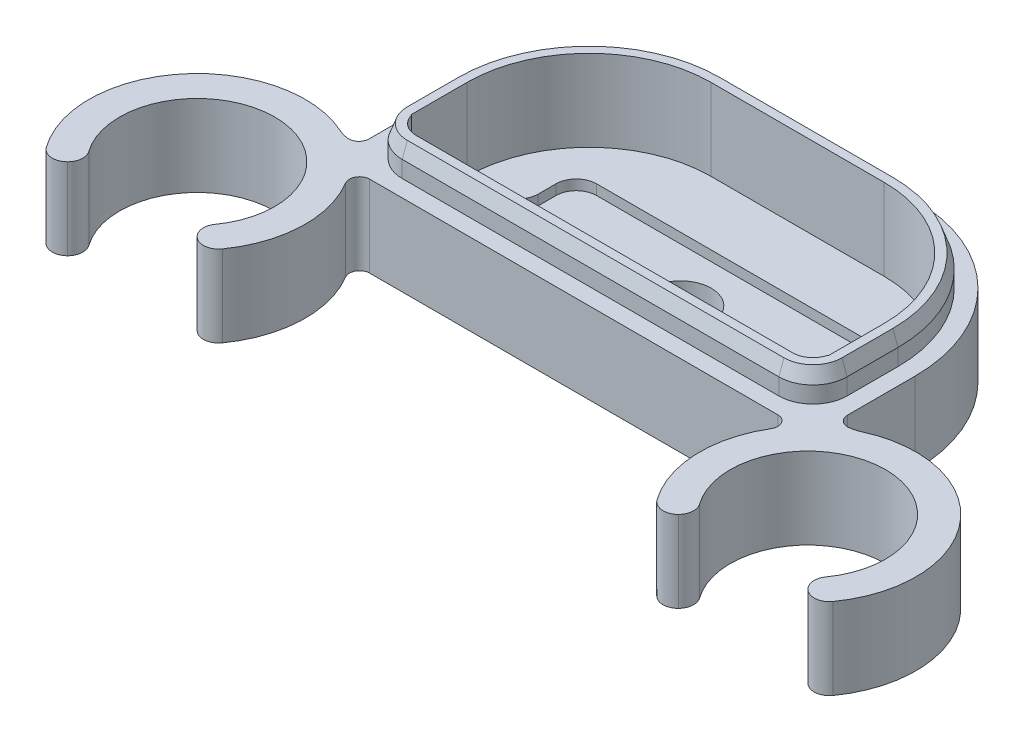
ISO-10303-21;
HEADER;
FILE_DESCRIPTION(('STEP AP214'),'2;1');
FILE_NAME('part.step','',(''),(''),'','','');
FILE_SCHEMA(('AUTOMOTIVE_DESIGN { 1 0 10303 214 1 1 1 1 }'));
ENDSEC;
DATA;
#1=APPLICATION_CONTEXT('core data for automotive mechanical design processes');
#2=APPLICATION_PROTOCOL_DEFINITION('international standard','automotive_design',2000,#1);
#3=PRODUCT_CONTEXT('',#1,'mechanical');
#4=PRODUCT('Part','Part','',(#3));
#5=PRODUCT_RELATED_PRODUCT_CATEGORY('part','',(#4));
#6=PRODUCT_DEFINITION_FORMATION('','',#4);
#7=PRODUCT_DEFINITION_CONTEXT('part definition',#1,'design');
#8=PRODUCT_DEFINITION('design','',#6,#7);
#9=PRODUCT_DEFINITION_SHAPE('','',#8);
#10=(LENGTH_UNIT() NAMED_UNIT(*) SI_UNIT(.MILLI.,.METRE.));
#11=(NAMED_UNIT(*) PLANE_ANGLE_UNIT() SI_UNIT($,.RADIAN.));
#12=(NAMED_UNIT(*) SI_UNIT($,.STERADIAN.) SOLID_ANGLE_UNIT());
#13=UNCERTAINTY_MEASURE_WITH_UNIT(LENGTH_MEASURE(1.E-05),#10,'distance_accuracy_value','');
#14=(GEOMETRIC_REPRESENTATION_CONTEXT(3) GLOBAL_UNCERTAINTY_ASSIGNED_CONTEXT((#13)) GLOBAL_UNIT_ASSIGNED_CONTEXT((#10,
#11,#12)) REPRESENTATION_CONTEXT('',''));
#15=CARTESIAN_POINT('',(0.,0.,0.));
#16=DIRECTION('',(0.,0.,1.));
#17=DIRECTION('',(1.,0.,0.));
#18=AXIS2_PLACEMENT_3D('',#15,#16,#17);
#19=CARTESIAN_POINT('',(30.,8.,19.5));
#20=DIRECTION('',(0.,-1.,0.));
#21=DIRECTION('',(0.,0.,-1.));
#22=AXIS2_PLACEMENT_3D('',#19,#20,#21);
#23=CYLINDRICAL_SURFACE('',#22,10.625);
#24=CARTESIAN_POINT('',(30.,8.,19.5));
#25=DIRECTION('',(0.,1.,0.));
#26=DIRECTION('',(0.,0.,-1.));
#27=AXIS2_PLACEMENT_3D('',#24,#25,#26);
#28=CIRCLE('',#27,10.625);
#29=CARTESIAN_POINT('',(38.6458215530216,8.,25.675791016));
#30=VERTEX_POINT('',#29);
#31=CARTESIAN_POINT('',(25.5634856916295,8.,9.84557273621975));
#32=VERTEX_POINT('',#31);
#33=EDGE_CURVE('E635',#30,#32,#28,.T.);
#34=ORIENTED_EDGE('',*,*,#33,.F.);
#35=DIRECTION('',(0.,-1.,0.));
#36=VECTOR('',#35,1.);
#37=CARTESIAN_POINT('',(38.6458215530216,8.,25.675791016));
#38=LINE('',#37,#36);
#39=CARTESIAN_POINT('',(38.6458215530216,0.,25.675791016));
#40=VERTEX_POINT('',#39);
#41=EDGE_CURVE('E896',#30,#40,#38,.T.);
#42=ORIENTED_EDGE('',*,*,#41,.T.);
#43=CARTESIAN_POINT('',(30.,0.,19.5));
#44=DIRECTION('',(0.,1.,0.));
#45=DIRECTION('',(0.,0.,-1.));
#46=AXIS2_PLACEMENT_3D('',#43,#44,#45);
#47=CIRCLE('',#46,10.625);
#48=CARTESIAN_POINT('',(25.5634856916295,0.,9.84557273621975));
#49=VERTEX_POINT('',#48);
#50=EDGE_CURVE('E629',#40,#49,#47,.T.);
#51=ORIENTED_EDGE('',*,*,#50,.T.);
#52=DIRECTION('',(0.,-1.,0.));
#53=VECTOR('',#52,1.);
#54=CARTESIAN_POINT('',(25.5634856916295,8.,9.84557273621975));
#55=LINE('',#54,#53);
#56=EDGE_CURVE('E771',#49,#32,#55,.F.);
#57=ORIENTED_EDGE('',*,*,#56,.T.);
#58=EDGE_LOOP('',(#34,#42,#51,#57));
#59=FACE_BOUND('',#58,.T.);
#60=ADVANCED_FACE('F38',(#59),#23,.T.);
#61=CARTESIAN_POINT('',(-30.,8.,19.5));
#62=DIRECTION('',(0.,-1.,0.));
#63=DIRECTION('',(0.,0.,-1.));
#64=AXIS2_PLACEMENT_3D('',#61,#62,#63);
#65=CYLINDRICAL_SURFACE('',#64,10.625);
#66=CARTESIAN_POINT('',(-30.,8.,19.5));
#67=DIRECTION('',(0.,1.,0.));
#68=DIRECTION('',(0.,0.,1.));
#69=AXIS2_PLACEMENT_3D('',#66,#67,#68);
#70=CIRCLE('',#69,10.625);
#71=CARTESIAN_POINT('',(-21.3541784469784,8.,25.675791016));
#72=VERTEX_POINT('',#71);
#73=CARTESIAN_POINT('',(-20.8995723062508,8.,14.0161290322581));
#74=VERTEX_POINT('',#73);
#75=EDGE_CURVE('E648',#72,#74,#70,.T.);
#76=ORIENTED_EDGE('',*,*,#75,.F.);
#77=DIRECTION('',(0.,-1.,0.));
#78=VECTOR('',#77,1.);
#79=CARTESIAN_POINT('',(-21.3541784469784,8.,25.675791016));
#80=LINE('',#79,#78);
#81=CARTESIAN_POINT('',(-21.3541784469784,0.,25.675791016));
#82=VERTEX_POINT('',#81);
#83=EDGE_CURVE('E47',#72,#82,#80,.T.);
#84=ORIENTED_EDGE('',*,*,#83,.T.);
#85=CARTESIAN_POINT('',(-30.,0.,19.5));
#86=DIRECTION('',(0.,1.,0.));
#87=DIRECTION('',(0.,0.,1.));
#88=AXIS2_PLACEMENT_3D('',#85,#86,#87);
#89=CIRCLE('',#88,10.625);
#90=CARTESIAN_POINT('',(-20.8995723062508,0.,14.0161290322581));
#91=VERTEX_POINT('',#90);
#92=EDGE_CURVE('E641',#82,#91,#89,.T.);
#93=ORIENTED_EDGE('',*,*,#92,.T.);
#94=DIRECTION('',(0.,-1.,0.));
#95=VECTOR('',#94,1.);
#96=CARTESIAN_POINT('',(-20.8995723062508,8.,14.0161290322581));
#97=LINE('',#96,#95);
#98=EDGE_CURVE('E797',#91,#74,#97,.F.);
#99=ORIENTED_EDGE('',*,*,#98,.T.);
#100=EDGE_LOOP('',(#76,#84,#93,#99));
#101=FACE_BOUND('',#100,.T.);
#102=ADVANCED_FACE('F1035',(#101),#65,.T.);
#103=CARTESIAN_POINT('',(0.,3.,0.));
#104=DIRECTION('',(0.,-1.,0.));
#105=DIRECTION('',(0.,0.,-1.));
#106=AXIS2_PLACEMENT_3D('',#103,#104,#105);
#107=PLANE('',#106);
#108=DIRECTION('',(1.,0.,0.));
#109=VECTOR('',#108,1.);
#110=CARTESIAN_POINT('',(0.,3.,8.));
#111=LINE('',#110,#109);
#112=CARTESIAN_POINT('',(-20.4364916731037,3.,8.));
#113=VERTEX_POINT('',#112);
#114=CARTESIAN_POINT('',(20.4364916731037,3.,8.));
#115=VERTEX_POINT('',#114);
#116=EDGE_CURVE('E534',#113,#115,#111,.T.);
#117=ORIENTED_EDGE('',*,*,#116,.F.);
#118=CARTESIAN_POINT('',(-18.5,3.,7.5));
#119=DIRECTION('',(0.,-1.,0.));
#120=DIRECTION('',(0.,0.,-1.));
#121=AXIS2_PLACEMENT_3D('',#118,#119,#120);
#122=CIRCLE('',#121,2.);
#123=CARTESIAN_POINT('',(-18.5,3.,9.5));
#124=VERTEX_POINT('',#123);
#125=EDGE_CURVE('E760',#113,#124,#122,.F.);
#126=ORIENTED_EDGE('',*,*,#125,.T.);
#127=DIRECTION('',(1.,0.,0.));
#128=VECTOR('',#127,1.);
#129=CARTESIAN_POINT('',(0.,3.,9.5));
#130=LINE('',#129,#128);
#131=CARTESIAN_POINT('',(18.5,3.,9.5));
#132=VERTEX_POINT('',#131);
#133=EDGE_CURVE('E694',#124,#132,#130,.T.);
#134=ORIENTED_EDGE('',*,*,#133,.T.);
#135=CARTESIAN_POINT('',(18.5,3.,7.5));
#136=DIRECTION('',(0.,-1.,0.));
#137=DIRECTION('',(0.,0.,-1.));
#138=AXIS2_PLACEMENT_3D('',#135,#136,#137);
#139=CIRCLE('',#138,2.);
#140=EDGE_CURVE('E757',#132,#115,#139,.F.);
#141=ORIENTED_EDGE('',*,*,#140,.T.);
#142=EDGE_LOOP('',(#117,#126,#134,#141));
#143=FACE_BOUND('',#142,.T.);
#144=ADVANCED_FACE('F1041',(#143),#107,.F.);
#145=DIRECTION('',(-1.,0.,0.));
#146=VECTOR('',#145,1.);
#147=CARTESIAN_POINT('',(0.,3.,2.5));
#148=LINE('',#147,#146);
#149=CARTESIAN_POINT('',(20.5,3.,2.5));
#150=VERTEX_POINT('',#149);
#151=CARTESIAN_POINT('',(17.5,3.,2.5));
#152=VERTEX_POINT('',#151);
#153=EDGE_CURVE('E530',#150,#152,#148,.T.);
#154=ORIENTED_EDGE('',*,*,#153,.F.);
#155=CARTESIAN_POINT('',(8.49999999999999,3.,2.5));
#156=DIRECTION('',(0.,-1.,0.));
#157=DIRECTION('',(0.,0.,-1.));
#158=AXIS2_PLACEMENT_3D('',#155,#156,#157);
#159=CIRCLE('',#158,12.);
#160=CARTESIAN_POINT('',(8.49999999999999,3.,-9.5));
#161=VERTEX_POINT('',#160);
#162=EDGE_CURVE('E728',#150,#161,#159,.F.);
#163=ORIENTED_EDGE('',*,*,#162,.T.);
#164=DIRECTION('',(-1.,0.,0.));
#165=VECTOR('',#164,1.);
#166=CARTESIAN_POINT('',(0.,3.,-9.5));
#167=LINE('',#166,#165);
#168=CARTESIAN_POINT('',(-8.50000000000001,3.,-9.5));
#169=VERTEX_POINT('',#168);
#170=EDGE_CURVE('E697',#161,#169,#167,.T.);
#171=ORIENTED_EDGE('',*,*,#170,.T.);
#172=CARTESIAN_POINT('',(-8.50000000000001,3.,2.5));
#173=DIRECTION('',(0.,-1.,0.));
#174=DIRECTION('',(0.,0.,-1.));
#175=AXIS2_PLACEMENT_3D('',#172,#173,#174);
#176=CIRCLE('',#175,12.);
#177=CARTESIAN_POINT('',(-20.5,3.,2.5));
#178=VERTEX_POINT('',#177);
#179=EDGE_CURVE('E725',#169,#178,#176,.F.);
#180=ORIENTED_EDGE('',*,*,#179,.T.);
#181=DIRECTION('',(-1.,0.,0.));
#182=VECTOR('',#181,1.);
#183=CARTESIAN_POINT('',(0.,3.,2.5));
#184=LINE('',#183,#182);
#185=CARTESIAN_POINT('',(-17.5,3.,2.5));
#186=VERTEX_POINT('',#185);
#187=EDGE_CURVE('E459',#186,#178,#184,.T.);
#188=ORIENTED_EDGE('',*,*,#187,.F.);
#189=CARTESIAN_POINT('',(-17.5,3.,0.500000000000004));
#190=DIRECTION('',(0.,-1.,0.));
#191=DIRECTION('',(0.,0.,-1.));
#192=AXIS2_PLACEMENT_3D('',#189,#190,#191);
#193=CIRCLE('',#192,2.);
#194=CARTESIAN_POINT('',(-15.5,3.,0.49999999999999));
#195=VERTEX_POINT('',#194);
#196=EDGE_CURVE('E882',#195,#186,#193,.T.);
#197=ORIENTED_EDGE('',*,*,#196,.F.);
#198=DIRECTION('',(0.,0.,1.));
#199=VECTOR('',#198,1.);
#200=CARTESIAN_POINT('',(-15.5,3.,0.));
#201=LINE('',#200,#199);
#202=CARTESIAN_POINT('',(-15.5,3.,-1.24999999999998));
#203=VERTEX_POINT('',#202);
#204=EDGE_CURVE('E884',#203,#195,#201,.T.);
#205=ORIENTED_EDGE('',*,*,#204,.F.);
#206=CARTESIAN_POINT('',(-13.5,3.,-1.25));
#207=DIRECTION('',(0.,-1.,0.));
#208=DIRECTION('',(0.,0.,-1.));
#209=AXIS2_PLACEMENT_3D('',#206,#207,#208);
#210=CIRCLE('',#209,2.);
#211=CARTESIAN_POINT('',(-13.5,3.,-3.25));
#212=VERTEX_POINT('',#211);
#213=EDGE_CURVE('E886',#212,#203,#210,.F.);
#214=ORIENTED_EDGE('',*,*,#213,.F.);
#215=DIRECTION('',(-1.,0.,0.));
#216=VECTOR('',#215,1.);
#217=CARTESIAN_POINT('',(0.,3.,-3.25));
#218=LINE('',#217,#216);
#219=CARTESIAN_POINT('',(13.5,3.,-3.25));
#220=VERTEX_POINT('',#219);
#221=EDGE_CURVE('E888',#220,#212,#218,.T.);
#222=ORIENTED_EDGE('',*,*,#221,.F.);
#223=CARTESIAN_POINT('',(13.5,3.,-1.25));
#224=DIRECTION('',(0.,-1.,0.));
#225=DIRECTION('',(0.,0.,-1.));
#226=AXIS2_PLACEMENT_3D('',#223,#224,#225);
#227=CIRCLE('',#226,2.);
#228=CARTESIAN_POINT('',(15.5,3.,-1.24999999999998));
#229=VERTEX_POINT('',#228);
#230=EDGE_CURVE('E890',#229,#220,#227,.F.);
#231=ORIENTED_EDGE('',*,*,#230,.F.);
#232=DIRECTION('',(0.,0.,-1.));
#233=VECTOR('',#232,1.);
#234=CARTESIAN_POINT('',(15.5,3.,0.));
#235=LINE('',#234,#233);
#236=CARTESIAN_POINT('',(15.5,3.,0.49999999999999));
#237=VERTEX_POINT('',#236);
#238=EDGE_CURVE('E892',#237,#229,#235,.T.);
#239=ORIENTED_EDGE('',*,*,#238,.F.);
#240=CARTESIAN_POINT('',(17.5,3.,0.500000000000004));
#241=DIRECTION('',(0.,-1.,0.));
#242=DIRECTION('',(0.,0.,-1.));
#243=AXIS2_PLACEMENT_3D('',#240,#241,#242);
#244=CIRCLE('',#243,2.);
#245=EDGE_CURVE('E894',#152,#237,#244,.T.);
#246=ORIENTED_EDGE('',*,*,#245,.F.);
#247=EDGE_LOOP('',(#154,#163,#171,#180,#188,#197,#205,#214,#222,#231,#239,#246));
#248=FACE_BOUND('',#247,.T.);
#249=ADVANCED_FACE('F1448',(#248),#107,.F.);
#250=CARTESIAN_POINT('',(-18.5,8.,7.5));
#251=DIRECTION('',(0.,1.,0.));
#252=DIRECTION('',(0.,0.,1.));
#253=AXIS2_PLACEMENT_3D('',#250,#251,#252);
#254=CYLINDRICAL_SURFACE('',#253,2.);
#255=DIRECTION('',(0.,1.,0.));
#256=VECTOR('',#255,1.);
#257=CARTESIAN_POINT('',(-20.4364916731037,8.,8.));
#258=LINE('',#257,#256);
#259=CARTESIAN_POINT('',(-20.4364916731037,11.,8.));
#260=VERTEX_POINT('',#259);
#261=EDGE_CURVE('E532',#260,#113,#258,.F.);
#262=ORIENTED_EDGE('',*,*,#261,.F.);
#263=CARTESIAN_POINT('',(-18.5,11.,7.5));
#264=DIRECTION('',(0.,1.,0.));
#265=DIRECTION('',(0.,0.,1.));
#266=AXIS2_PLACEMENT_3D('',#263,#264,#265);
#267=CIRCLE('',#266,2.);
#268=CARTESIAN_POINT('',(-18.5,11.,9.5));
#269=VERTEX_POINT('',#268);
#270=EDGE_CURVE('E574',#260,#269,#267,.T.);
#271=ORIENTED_EDGE('',*,*,#270,.T.);
#272=DIRECTION('',(0.,-1.,0.));
#273=VECTOR('',#272,1.);
#274=CARTESIAN_POINT('',(-18.5,8.,9.5));
#275=LINE('',#274,#273);
#276=EDGE_CURVE('E765',#124,#269,#275,.F.);
#277=ORIENTED_EDGE('',*,*,#276,.F.);
#278=ORIENTED_EDGE('',*,*,#125,.F.);
#279=EDGE_LOOP('',(#262,#271,#277,#278));
#280=FACE_BOUND('',#279,.T.);
#281=ADVANCED_FACE('F1437',(#280),#254,.F.);
#282=CARTESIAN_POINT('',(18.5,8.,7.5));
#283=DIRECTION('',(0.,1.,0.));
#284=DIRECTION('',(0.,0.,1.));
#285=AXIS2_PLACEMENT_3D('',#282,#283,#284);
#286=CYLINDRICAL_SURFACE('',#285,2.);
#287=DIRECTION('',(0.,1.,0.));
#288=VECTOR('',#287,1.);
#289=CARTESIAN_POINT('',(20.4364916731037,8.,8.));
#290=LINE('',#289,#288);
#291=CARTESIAN_POINT('',(20.4364916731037,11.,8.));
#292=VERTEX_POINT('',#291);
#293=EDGE_CURVE('E536',#115,#292,#290,.T.);
#294=ORIENTED_EDGE('',*,*,#293,.F.);
#295=ORIENTED_EDGE('',*,*,#140,.F.);
#296=DIRECTION('',(0.,-1.,0.));
#297=VECTOR('',#296,1.);
#298=CARTESIAN_POINT('',(18.5,3.,9.5));
#299=LINE('',#298,#297);
#300=CARTESIAN_POINT('',(18.5,11.,9.50000000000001));
#301=VERTEX_POINT('',#300);
#302=EDGE_CURVE('E762',#301,#132,#299,.T.);
#303=ORIENTED_EDGE('',*,*,#302,.F.);
#304=CARTESIAN_POINT('',(18.5,11.,7.5));
#305=DIRECTION('',(0.,1.,0.));
#306=DIRECTION('',(0.,0.,1.));
#307=AXIS2_PLACEMENT_3D('',#304,#305,#306);
#308=CIRCLE('',#307,2.);
#309=EDGE_CURVE('E579',#301,#292,#308,.T.);
#310=ORIENTED_EDGE('',*,*,#309,.T.);
#311=EDGE_LOOP('',(#294,#295,#303,#310));
#312=FACE_BOUND('',#311,.T.);
#313=ADVANCED_FACE('F1425',(#312),#286,.F.);
#314=CARTESIAN_POINT('',(-8.50000000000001,11.,2.5));
#315=DIRECTION('',(0.,1.,0.));
#316=DIRECTION('',(0.,0.,1.));
#317=AXIS2_PLACEMENT_3D('',#314,#315,#316);
#318=PLANE('',#317);
#319=CARTESIAN_POINT('',(-18.5,11.,7.5));
#320=DIRECTION('',(0.,1.,0.));
#321=DIRECTION('',(0.,0.,1.));
#322=AXIS2_PLACEMENT_3D('',#319,#320,#321);
#323=CIRCLE('',#322,2.84999999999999);
#324=CARTESIAN_POINT('',(-21.35,11.,7.5));
#325=VERTEX_POINT('',#324);
#326=CARTESIAN_POINT('',(-18.5,11.,10.35));
#327=VERTEX_POINT('',#326);
#328=EDGE_CURVE('E822',#325,#327,#323,.T.);
#329=ORIENTED_EDGE('',*,*,#328,.T.);
#330=DIRECTION('',(1.,0.,0.));
#331=VECTOR('',#330,1.);
#332=CARTESIAN_POINT('',(18.5,11.,10.35));
#333=LINE('',#332,#331);
#334=CARTESIAN_POINT('',(18.5,11.,10.35));
#335=VERTEX_POINT('',#334);
#336=EDGE_CURVE('E836',#327,#335,#333,.T.);
#337=ORIENTED_EDGE('',*,*,#336,.T.);
#338=CARTESIAN_POINT('',(18.5,11.,7.5));
#339=DIRECTION('',(0.,1.,0.));
#340=DIRECTION('',(0.,0.,1.));
#341=AXIS2_PLACEMENT_3D('',#338,#339,#340);
#342=CIRCLE('',#341,2.84999999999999);
#343=CARTESIAN_POINT('',(21.35,11.,7.5));
#344=VERTEX_POINT('',#343);
#345=EDGE_CURVE('E834',#335,#344,#342,.T.);
#346=ORIENTED_EDGE('',*,*,#345,.T.);
#347=DIRECTION('',(0.,0.,-1.));
#348=VECTOR('',#347,1.);
#349=CARTESIAN_POINT('',(21.35,11.,2.5));
#350=LINE('',#349,#348);
#351=CARTESIAN_POINT('',(21.35,11.,2.5));
#352=VERTEX_POINT('',#351);
#353=EDGE_CURVE('E832',#344,#352,#350,.T.);
#354=ORIENTED_EDGE('',*,*,#353,.T.);
#355=CARTESIAN_POINT('',(8.49999999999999,11.,2.5));
#356=DIRECTION('',(0.,1.,0.));
#357=DIRECTION('',(0.,0.,1.));
#358=AXIS2_PLACEMENT_3D('',#355,#356,#357);
#359=CIRCLE('',#358,12.85);
#360=CARTESIAN_POINT('',(8.49999999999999,11.,-10.35));
#361=VERTEX_POINT('',#360);
#362=EDGE_CURVE('E830',#352,#361,#359,.T.);
#363=ORIENTED_EDGE('',*,*,#362,.T.);
#364=DIRECTION('',(-1.,0.,0.));
#365=VECTOR('',#364,1.);
#366=CARTESIAN_POINT('',(-8.50000000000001,11.,-10.35));
#367=LINE('',#366,#365);
#368=CARTESIAN_POINT('',(-8.50000000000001,11.,-10.35));
#369=VERTEX_POINT('',#368);
#370=EDGE_CURVE('E828',#361,#369,#367,.T.);
#371=ORIENTED_EDGE('',*,*,#370,.T.);
#372=CARTESIAN_POINT('',(-8.50000000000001,11.,2.5));
#373=DIRECTION('',(0.,1.,0.));
#374=DIRECTION('',(0.,0.,1.));
#375=AXIS2_PLACEMENT_3D('',#372,#373,#374);
#376=CIRCLE('',#375,12.85);
#377=CARTESIAN_POINT('',(-21.35,11.,2.5));
#378=VERTEX_POINT('',#377);
#379=EDGE_CURVE('E826',#369,#378,#376,.T.);
#380=ORIENTED_EDGE('',*,*,#379,.T.);
#381=DIRECTION('',(0.,0.,1.));
#382=VECTOR('',#381,1.);
#383=CARTESIAN_POINT('',(-21.35,11.,7.5));
#384=LINE('',#383,#382);
#385=EDGE_CURVE('E824',#378,#325,#384,.T.);
#386=ORIENTED_EDGE('',*,*,#385,.T.);
#387=EDGE_LOOP('',(#329,#337,#346,#354,#363,#371,#380,#386));
#388=FACE_BOUND('',#387,.T.);
#389=DIRECTION('',(0.,0.,-1.));
#390=VECTOR('',#389,1.);
#391=CARTESIAN_POINT('',(20.5,11.,7.5));
#392=LINE('',#391,#390);
#393=CARTESIAN_POINT('',(20.5,11.,8.));
#394=VERTEX_POINT('',#393);
#395=CARTESIAN_POINT('',(20.5,11.,2.5));
#396=VERTEX_POINT('',#395);
#397=EDGE_CURVE('E582',#394,#396,#392,.T.);
#398=ORIENTED_EDGE('',*,*,#397,.F.);
#399=DIRECTION('',(-1.,0.,0.));
#400=VECTOR('',#399,1.);
#401=CARTESIAN_POINT('',(-8.50000000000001,11.,8.));
#402=LINE('',#401,#400);
#403=EDGE_CURVE('E878',#394,#292,#402,.T.);
#404=ORIENTED_EDGE('',*,*,#403,.T.);
#405=ORIENTED_EDGE('',*,*,#309,.F.);
#406=DIRECTION('',(1.,0.,0.));
#407=VECTOR('',#406,1.);
#408=CARTESIAN_POINT('',(-18.5,11.,9.5));
#409=LINE('',#408,#407);
#410=EDGE_CURVE('E576',#269,#301,#409,.T.);
#411=ORIENTED_EDGE('',*,*,#410,.F.);
#412=ORIENTED_EDGE('',*,*,#270,.F.);
#413=CARTESIAN_POINT('',(-20.5,11.,8.));
#414=VERTEX_POINT('',#413);
#415=EDGE_CURVE('E856',#260,#414,#402,.T.);
#416=ORIENTED_EDGE('',*,*,#415,.T.);
#417=DIRECTION('',(0.,0.,1.));
#418=VECTOR('',#417,1.);
#419=CARTESIAN_POINT('',(-20.5,11.,2.5));
#420=LINE('',#419,#418);
#421=CARTESIAN_POINT('',(-20.5,11.,2.5));
#422=VERTEX_POINT('',#421);
#423=EDGE_CURVE('E456',#422,#414,#420,.T.);
#424=ORIENTED_EDGE('',*,*,#423,.F.);
#425=CARTESIAN_POINT('',(-8.50000000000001,11.,2.5));
#426=DIRECTION('',(0.,1.,0.));
#427=DIRECTION('',(0.,0.,1.));
#428=AXIS2_PLACEMENT_3D('',#425,#426,#427);
#429=CIRCLE('',#428,12.);
#430=CARTESIAN_POINT('',(-8.50000000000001,11.,-9.5));
#431=VERTEX_POINT('',#430);
#432=EDGE_CURVE('E570',#431,#422,#429,.T.);
#433=ORIENTED_EDGE('',*,*,#432,.F.);
#434=DIRECTION('',(-1.,0.,0.));
#435=VECTOR('',#434,1.);
#436=CARTESIAN_POINT('',(8.49999999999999,11.,-9.5));
#437=LINE('',#436,#435);
#438=CARTESIAN_POINT('',(8.49999999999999,11.,-9.5));
#439=VERTEX_POINT('',#438);
#440=EDGE_CURVE('E566',#439,#431,#437,.T.);
#441=ORIENTED_EDGE('',*,*,#440,.F.);
#442=CARTESIAN_POINT('',(8.49999999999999,11.,2.5));
#443=DIRECTION('',(0.,1.,0.));
#444=DIRECTION('',(0.,0.,1.));
#445=AXIS2_PLACEMENT_3D('',#442,#443,#444);
#446=CIRCLE('',#445,12.);
#447=EDGE_CURVE('E563',#396,#439,#446,.T.);
#448=ORIENTED_EDGE('',*,*,#447,.F.);
#449=EDGE_LOOP('',(#398,#404,#405,#411,#412,#416,#424,#433,#441,#448));
#450=FACE_BOUND('',#449,.T.);
#451=ADVANCED_FACE('F1156',(#388,#450),#318,.T.);
#452=CARTESIAN_POINT('',(0.,8.,0.));
#453=DIRECTION('',(0.,-1.,0.));
#454=DIRECTION('',(0.,0.,-1.));
#455=AXIS2_PLACEMENT_3D('',#452,#453,#454);
#456=PLANE('',#455);
#457=CARTESIAN_POINT('',(37.4252349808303,8.,24.8039146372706));
#458=DIRECTION('',(0.,-1.,0.));
#459=DIRECTION('',(0.,0.,-1.));
#460=AXIS2_PLACEMENT_3D('',#457,#458,#459);
#461=CIRCLE('',#460,1.5);
#462=CARTESIAN_POINT('',(36.204648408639,8.,23.9320382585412));
#463=VERTEX_POINT('',#462);
#464=CARTESIAN_POINT('',(36.3645748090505,8.,25.8645748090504));
#465=VERTEX_POINT('',#464);
#466=EDGE_CURVE('E926',#463,#465,#461,.F.);
#467=ORIENTED_EDGE('',*,*,#466,.T.);
#468=CARTESIAN_POINT('',(37.4252349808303,8.,24.8039146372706));
#469=DIRECTION('',(0.,-1.,0.));
#470=DIRECTION('',(0.,0.,-1.));
#471=AXIS2_PLACEMENT_3D('',#468,#469,#470);
#472=CIRCLE('',#471,1.5);
#473=EDGE_CURVE('E928',#465,#30,#472,.F.);
#474=ORIENTED_EDGE('',*,*,#473,.T.);
#475=ORIENTED_EDGE('',*,*,#33,.T.);
#476=CARTESIAN_POINT('',(24.3108228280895,8.,7.11961680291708));
#477=DIRECTION('',(0.,-1.,0.));
#478=DIRECTION('',(0.,0.,-1.));
#479=AXIS2_PLACEMENT_3D('',#476,#477,#478);
#480=CIRCLE('',#479,3.);
#481=CARTESIAN_POINT('',(24.5945885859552,8.,10.1061661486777));
#482=VERTEX_POINT('',#481);
#483=EDGE_CURVE('E782',#32,#482,#480,.T.);
#484=ORIENTED_EDGE('',*,*,#483,.T.);
#485=CARTESIAN_POINT('',(24.5,8.,9.1106497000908));
#486=DIRECTION('',(0.,-1.,0.));
#487=DIRECTION('',(0.,0.,-1.));
#488=AXIS2_PLACEMENT_3D('',#485,#486,#487);
#489=CIRCLE('',#488,1.);
#490=CARTESIAN_POINT('',(23.5,8.,9.1106497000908));
#491=VERTEX_POINT('',#490);
#492=EDGE_CURVE('E809',#482,#491,#489,.T.);
#493=ORIENTED_EDGE('',*,*,#492,.T.);
#494=DIRECTION('',(0.,0.,-1.));
#495=VECTOR('',#494,1.);
#496=CARTESIAN_POINT('',(23.5,8.,12.5));
#497=LINE('',#496,#495);
#498=CARTESIAN_POINT('',(23.5,8.,2.50000000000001));
#499=VERTEX_POINT('',#498);
#500=EDGE_CURVE('E708',#491,#499,#497,.T.);
#501=ORIENTED_EDGE('',*,*,#500,.T.);
#502=CARTESIAN_POINT('',(8.49999999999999,8.,2.5));
#503=DIRECTION('',(0.,-1.,0.));
#504=DIRECTION('',(0.,0.,-1.));
#505=AXIS2_PLACEMENT_3D('',#502,#503,#504);
#506=CIRCLE('',#505,15.);
#507=CARTESIAN_POINT('',(8.49999999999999,8.,-12.5));
#508=VERTEX_POINT('',#507);
#509=EDGE_CURVE('E752',#499,#508,#506,.F.);
#510=ORIENTED_EDGE('',*,*,#509,.T.);
#511=DIRECTION('',(-1.,0.,0.));
#512=VECTOR('',#511,1.);
#513=CARTESIAN_POINT('',(-23.5,8.,-12.5));
#514=LINE('',#513,#512);
#515=CARTESIAN_POINT('',(-8.50000000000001,8.,-12.5));
#516=VERTEX_POINT('',#515);
#517=EDGE_CURVE('E710',#508,#516,#514,.T.);
#518=ORIENTED_EDGE('',*,*,#517,.T.);
#519=CARTESIAN_POINT('',(-8.50000000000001,8.,2.5));
#520=DIRECTION('',(0.,-1.,0.));
#521=DIRECTION('',(0.,0.,-1.));
#522=AXIS2_PLACEMENT_3D('',#519,#520,#521);
#523=CIRCLE('',#522,15.);
#524=CARTESIAN_POINT('',(-23.5,8.,2.50000000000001));
#525=VERTEX_POINT('',#524);
#526=EDGE_CURVE('E750',#516,#525,#523,.F.);
#527=ORIENTED_EDGE('',*,*,#526,.T.);
#528=DIRECTION('',(0.,0.,1.));
#529=VECTOR('',#528,1.);
#530=CARTESIAN_POINT('',(-23.5,8.,12.5));
#531=LINE('',#530,#529);
#532=CARTESIAN_POINT('',(-23.5,8.,9.11064970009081));
#533=VERTEX_POINT('',#532);
#534=EDGE_CURVE('E701',#525,#533,#531,.T.);
#535=ORIENTED_EDGE('',*,*,#534,.T.);
#536=CARTESIAN_POINT('',(-24.5,8.,9.11064970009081));
#537=DIRECTION('',(0.,-1.,0.));
#538=DIRECTION('',(0.,0.,-1.));
#539=AXIS2_PLACEMENT_3D('',#536,#537,#538);
#540=CIRCLE('',#539,1.);
#541=CARTESIAN_POINT('',(-24.5945885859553,8.,10.1061661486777));
#542=VERTEX_POINT('',#541);
#543=EDGE_CURVE('E820',#533,#542,#540,.T.);
#544=ORIENTED_EDGE('',*,*,#543,.T.);
#545=CARTESIAN_POINT('',(-24.3108228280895,8.,7.1196168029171));
#546=DIRECTION('',(0.,-1.,0.));
#547=DIRECTION('',(0.,0.,-1.));
#548=AXIS2_PLACEMENT_3D('',#545,#546,#547);
#549=CIRCLE('',#548,3.);
#550=CARTESIAN_POINT('',(-25.5634856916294,8.,9.84557273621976));
#551=VERTEX_POINT('',#550);
#552=EDGE_CURVE('E777',#542,#551,#549,.T.);
#553=ORIENTED_EDGE('',*,*,#552,.T.);
#554=CARTESIAN_POINT('',(-38.6458215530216,8.,25.675791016));
#555=VERTEX_POINT('',#554);
#556=EDGE_CURVE('E644',#551,#555,#70,.T.);
#557=ORIENTED_EDGE('',*,*,#556,.T.);
#558=CARTESIAN_POINT('',(-37.4252349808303,8.,24.8039146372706));
#559=DIRECTION('',(0.,-1.,0.));
#560=DIRECTION('',(0.,0.,-1.));
#561=AXIS2_PLACEMENT_3D('',#558,#559,#560);
#562=CIRCLE('',#561,1.5);
#563=CARTESIAN_POINT('',(-36.3645748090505,8.,25.8645748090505));
#564=VERTEX_POINT('',#563);
#565=EDGE_CURVE('E915',#555,#564,#562,.F.);
#566=ORIENTED_EDGE('',*,*,#565,.T.);
#567=CARTESIAN_POINT('',(-37.4252349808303,8.,24.8039146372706));
#568=DIRECTION('',(0.,-1.,0.));
#569=DIRECTION('',(0.,0.,-1.));
#570=AXIS2_PLACEMENT_3D('',#567,#568,#569);
#571=CIRCLE('',#570,1.5);
#572=CARTESIAN_POINT('',(-36.204648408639,8.,23.9320382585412));
#573=VERTEX_POINT('',#572);
#574=EDGE_CURVE('E917',#564,#573,#571,.F.);
#575=ORIENTED_EDGE('',*,*,#574,.T.);
#576=CARTESIAN_POINT('',(-30.,8.,19.5));
#577=DIRECTION('',(0.,1.,0.));
#578=DIRECTION('',(0.,0.,1.));
#579=AXIS2_PLACEMENT_3D('',#576,#577,#578);
#580=CIRCLE('',#579,7.625);
#581=CARTESIAN_POINT('',(-23.795351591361,8.,23.9320382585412));
#582=VERTEX_POINT('',#581);
#583=EDGE_CURVE('E638',#582,#573,#580,.T.);
#584=ORIENTED_EDGE('',*,*,#583,.F.);
#585=CARTESIAN_POINT('',(-22.5747650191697,8.,24.8039146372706));
#586=DIRECTION('',(0.,-1.,0.));
#587=DIRECTION('',(0.,0.,-1.));
#588=AXIS2_PLACEMENT_3D('',#585,#586,#587);
#589=CIRCLE('',#588,1.5);
#590=CARTESIAN_POINT('',(-23.6354251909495,8.,25.8645748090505));
#591=VERTEX_POINT('',#590);
#592=EDGE_CURVE('E921',#582,#591,#589,.F.);
#593=ORIENTED_EDGE('',*,*,#592,.T.);
#594=CARTESIAN_POINT('',(-22.5747650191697,8.,24.8039146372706));
#595=DIRECTION('',(0.,-1.,0.));
#596=DIRECTION('',(0.,0.,-1.));
#597=AXIS2_PLACEMENT_3D('',#594,#595,#596);
#598=CIRCLE('',#597,1.5);
#599=EDGE_CURVE('E919',#591,#72,#598,.F.);
#600=ORIENTED_EDGE('',*,*,#599,.T.);
#601=ORIENTED_EDGE('',*,*,#75,.T.);
#602=CARTESIAN_POINT('',(-20.0430614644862,8.,13.5));
#603=DIRECTION('',(0.,-1.,0.));
#604=DIRECTION('',(0.,0.,-1.));
#605=AXIS2_PLACEMENT_3D('',#602,#603,#604);
#606=CIRCLE('',#605,1.);
#607=CARTESIAN_POINT('',(-20.0430614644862,8.,12.5));
#608=VERTEX_POINT('',#607);
#609=EDGE_CURVE('E813',#74,#608,#606,.T.);
#610=ORIENTED_EDGE('',*,*,#609,.T.);
#611=DIRECTION('',(1.,0.,0.));
#612=VECTOR('',#611,1.);
#613=CARTESIAN_POINT('',(-23.5,8.,12.5));
#614=LINE('',#613,#612);
#615=CARTESIAN_POINT('',(20.0430614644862,8.,12.5));
#616=VERTEX_POINT('',#615);
#617=EDGE_CURVE('E704',#608,#616,#614,.T.);
#618=ORIENTED_EDGE('',*,*,#617,.T.);
#619=CARTESIAN_POINT('',(20.0430614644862,8.,13.5));
#620=DIRECTION('',(0.,-1.,0.));
#621=DIRECTION('',(0.,0.,-1.));
#622=AXIS2_PLACEMENT_3D('',#619,#620,#621);
#623=CIRCLE('',#622,1.);
#624=CARTESIAN_POINT('',(20.8995723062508,8.,14.0161290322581));
#625=VERTEX_POINT('',#624);
#626=EDGE_CURVE('E807',#616,#625,#623,.T.);
#627=ORIENTED_EDGE('',*,*,#626,.T.);
#628=CARTESIAN_POINT('',(21.3541784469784,8.,25.675791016));
#629=VERTEX_POINT('',#628);
#630=EDGE_CURVE('E632',#625,#629,#28,.T.);
#631=ORIENTED_EDGE('',*,*,#630,.T.);
#632=CARTESIAN_POINT('',(22.5747650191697,8.,24.8039146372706));
#633=DIRECTION('',(0.,-1.,0.));
#634=DIRECTION('',(0.,0.,-1.));
#635=AXIS2_PLACEMENT_3D('',#632,#633,#634);
#636=CIRCLE('',#635,1.5);
#637=CARTESIAN_POINT('',(23.6354251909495,8.,25.8645748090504));
#638=VERTEX_POINT('',#637);
#639=EDGE_CURVE('E55',#629,#638,#636,.F.);
#640=ORIENTED_EDGE('',*,*,#639,.T.);
#641=CARTESIAN_POINT('',(22.5747650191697,8.,24.8039146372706));
#642=DIRECTION('',(0.,-1.,0.));
#643=DIRECTION('',(0.,0.,-1.));
#644=AXIS2_PLACEMENT_3D('',#641,#642,#643);
#645=CIRCLE('',#644,1.5);
#646=CARTESIAN_POINT('',(23.795351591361,8.,23.9320382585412));
#647=VERTEX_POINT('',#646);
#648=EDGE_CURVE('E924',#638,#647,#645,.F.);
#649=ORIENTED_EDGE('',*,*,#648,.T.);
#650=CARTESIAN_POINT('',(30.,8.,19.5));
#651=DIRECTION('',(0.,1.,0.));
#652=DIRECTION('',(0.,0.,-1.));
#653=AXIS2_PLACEMENT_3D('',#650,#651,#652);
#654=CIRCLE('',#653,7.625);
#655=EDGE_CURVE('E626',#463,#647,#654,.T.);
#656=ORIENTED_EDGE('',*,*,#655,.F.);
#657=EDGE_LOOP('',(#467,#474,#475,#484,#493,#501,#510,#518,#527,#535,#544,#553,#557,#566,#575,
#584,#593,#600,#601,#610,#618,#627,#631,#640,#649,#656));
#658=FACE_BOUND('',#657,.T.);
#659=CARTESIAN_POINT('',(-8.50000000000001,8.,2.5));
#660=DIRECTION('',(0.,1.,0.));
#661=DIRECTION('',(0.,0.,1.));
#662=AXIS2_PLACEMENT_3D('',#659,#660,#661);
#663=CIRCLE('',#662,13.35);
#664=CARTESIAN_POINT('',(-8.50000000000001,8.,-10.85));
#665=VERTEX_POINT('',#664);
#666=CARTESIAN_POINT('',(-21.85,8.,2.5));
#667=VERTEX_POINT('',#666);
#668=EDGE_CURVE('E585',#665,#667,#663,.T.);
#669=ORIENTED_EDGE('',*,*,#668,.F.);
#670=DIRECTION('',(-1.,0.,0.));
#671=VECTOR('',#670,1.);
#672=CARTESIAN_POINT('',(8.49999999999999,8.,-10.85));
#673=LINE('',#672,#671);
#674=CARTESIAN_POINT('',(8.49999999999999,8.,-10.85));
#675=VERTEX_POINT('',#674);
#676=EDGE_CURVE('E606',#675,#665,#673,.T.);
#677=ORIENTED_EDGE('',*,*,#676,.F.);
#678=CARTESIAN_POINT('',(8.49999999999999,8.,2.5));
#679=DIRECTION('',(0.,1.,0.));
#680=DIRECTION('',(0.,0.,1.));
#681=AXIS2_PLACEMENT_3D('',#678,#679,#680);
#682=CIRCLE('',#681,13.35);
#683=CARTESIAN_POINT('',(21.85,8.,2.5));
#684=VERTEX_POINT('',#683);
#685=EDGE_CURVE('E603',#684,#675,#682,.T.);
#686=ORIENTED_EDGE('',*,*,#685,.F.);
#687=DIRECTION('',(0.,0.,-1.));
#688=VECTOR('',#687,1.);
#689=CARTESIAN_POINT('',(21.85,8.,7.5));
#690=LINE('',#689,#688);
#691=CARTESIAN_POINT('',(21.85,8.,7.5));
#692=VERTEX_POINT('',#691);
#693=EDGE_CURVE('E600',#692,#684,#690,.T.);
#694=ORIENTED_EDGE('',*,*,#693,.F.);
#695=CARTESIAN_POINT('',(18.5,8.,7.5));
#696=DIRECTION('',(0.,1.,0.));
#697=DIRECTION('',(0.,0.,1.));
#698=AXIS2_PLACEMENT_3D('',#695,#696,#697);
#699=CIRCLE('',#698,3.35);
#700=CARTESIAN_POINT('',(18.5,8.,10.85));
#701=VERTEX_POINT('',#700);
#702=EDGE_CURVE('E597',#701,#692,#699,.T.);
#703=ORIENTED_EDGE('',*,*,#702,.F.);
#704=DIRECTION('',(1.,0.,0.));
#705=VECTOR('',#704,1.);
#706=CARTESIAN_POINT('',(-18.5,8.,10.85));
#707=LINE('',#706,#705);
#708=CARTESIAN_POINT('',(-18.5,8.,10.85));
#709=VERTEX_POINT('',#708);
#710=EDGE_CURVE('E594',#709,#701,#707,.T.);
#711=ORIENTED_EDGE('',*,*,#710,.F.);
#712=CARTESIAN_POINT('',(-18.5,8.,7.5));
#713=DIRECTION('',(0.,1.,0.));
#714=DIRECTION('',(0.,0.,1.));
#715=AXIS2_PLACEMENT_3D('',#712,#713,#714);
#716=CIRCLE('',#715,3.35);
#717=CARTESIAN_POINT('',(-21.85,8.,7.5));
#718=VERTEX_POINT('',#717);
#719=EDGE_CURVE('E591',#718,#709,#716,.T.);
#720=ORIENTED_EDGE('',*,*,#719,.F.);
#721=DIRECTION('',(0.,0.,1.));
#722=VECTOR('',#721,1.);
#723=CARTESIAN_POINT('',(-21.85,8.,2.5));
#724=LINE('',#723,#722);
#725=EDGE_CURVE('E588',#667,#718,#724,.T.);
#726=ORIENTED_EDGE('',*,*,#725,.F.);
#727=EDGE_LOOP('',(#669,#677,#686,#694,#703,#711,#720,#726));
#728=FACE_BOUND('',#727,.T.);
#729=ADVANCED_FACE('F981',(#658,#728),#456,.F.);
#730=CARTESIAN_POINT('',(-23.5,8.,12.5));
#731=DIRECTION('',(0.,0.,-1.));
#732=DIRECTION('',(-1.,0.,0.));
#733=AXIS2_PLACEMENT_3D('',#730,#731,#732);
#734=PLANE('',#733);
#735=DIRECTION('',(1.,0.,0.));
#736=VECTOR('',#735,1.);
#737=CARTESIAN_POINT('',(-23.5,0.,12.5));
#738=LINE('',#737,#736);
#739=CARTESIAN_POINT('',(-20.0430614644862,0.,12.5));
#740=VERTEX_POINT('',#739);
#741=CARTESIAN_POINT('',(20.0430614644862,0.,12.5));
#742=VERTEX_POINT('',#741);
#743=EDGE_CURVE('E716',#740,#742,#738,.T.);
#744=ORIENTED_EDGE('',*,*,#743,.T.);
#745=DIRECTION('',(0.,1.,0.));
#746=VECTOR('',#745,1.);
#747=CARTESIAN_POINT('',(20.0430614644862,8.,12.5));
#748=LINE('',#747,#746);
#749=EDGE_CURVE('E790',#742,#616,#748,.T.);
#750=ORIENTED_EDGE('',*,*,#749,.T.);
#751=ORIENTED_EDGE('',*,*,#617,.F.);
#752=DIRECTION('',(0.,1.,0.));
#753=VECTOR('',#752,1.);
#754=CARTESIAN_POINT('',(-20.0430614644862,0.,12.5));
#755=LINE('',#754,#753);
#756=EDGE_CURVE('E788',#608,#740,#755,.F.);
#757=ORIENTED_EDGE('',*,*,#756,.T.);
#758=EDGE_LOOP('',(#744,#750,#751,#757));
#759=FACE_BOUND('',#758,.T.);
#760=ADVANCED_FACE('F1155',(#759),#734,.F.);
#761=CARTESIAN_POINT('',(23.5,8.,12.5));
#762=DIRECTION('',(-1.,0.,0.));
#763=DIRECTION('',(0.,0.,1.));
#764=AXIS2_PLACEMENT_3D('',#761,#762,#763);
#765=PLANE('',#764);
#766=ORIENTED_EDGE('',*,*,#500,.F.);
#767=DIRECTION('',(0.,-1.,0.));
#768=VECTOR('',#767,1.);
#769=CARTESIAN_POINT('',(23.5,0.,9.1106497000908));
#770=LINE('',#769,#768);
#771=CARTESIAN_POINT('',(23.5,0.,9.1106497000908));
#772=VERTEX_POINT('',#771);
#773=EDGE_CURVE('E795',#491,#772,#770,.T.);
#774=ORIENTED_EDGE('',*,*,#773,.T.);
#775=DIRECTION('',(0.,0.,-1.));
#776=VECTOR('',#775,1.);
#777=CARTESIAN_POINT('',(23.5,0.,12.5));
#778=LINE('',#777,#776);
#779=CARTESIAN_POINT('',(23.5,0.,2.50000000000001));
#780=VERTEX_POINT('',#779);
#781=EDGE_CURVE('E719',#772,#780,#778,.T.);
#782=ORIENTED_EDGE('',*,*,#781,.T.);
#783=DIRECTION('',(0.,-1.,0.));
#784=VECTOR('',#783,1.);
#785=CARTESIAN_POINT('',(23.5,8.,2.5));
#786=LINE('',#785,#784);
#787=EDGE_CURVE('E747',#780,#499,#786,.F.);
#788=ORIENTED_EDGE('',*,*,#787,.T.);
#789=EDGE_LOOP('',(#766,#774,#782,#788));
#790=FACE_BOUND('',#789,.T.);
#791=ADVANCED_FACE('F1680',(#790),#765,.F.);
#792=CARTESIAN_POINT('',(-23.5,8.,12.5));
#793=DIRECTION('',(1.,0.,0.));
#794=DIRECTION('',(0.,0.,-1.));
#795=AXIS2_PLACEMENT_3D('',#792,#793,#794);
#796=PLANE('',#795);
#797=DIRECTION('',(0.,0.,1.));
#798=VECTOR('',#797,1.);
#799=CARTESIAN_POINT('',(-23.5,0.,12.5));
#800=LINE('',#799,#798);
#801=CARTESIAN_POINT('',(-23.5,0.,2.50000000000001));
#802=VERTEX_POINT('',#801);
#803=CARTESIAN_POINT('',(-23.5,0.,9.11064970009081));
#804=VERTEX_POINT('',#803);
#805=EDGE_CURVE('E700',#802,#804,#800,.T.);
#806=ORIENTED_EDGE('',*,*,#805,.T.);
#807=DIRECTION('',(0.,-1.,0.));
#808=VECTOR('',#807,1.);
#809=CARTESIAN_POINT('',(-23.5,8.,9.11064970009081));
#810=LINE('',#809,#808);
#811=EDGE_CURVE('E803',#804,#533,#810,.F.);
#812=ORIENTED_EDGE('',*,*,#811,.T.);
#813=ORIENTED_EDGE('',*,*,#534,.F.);
#814=DIRECTION('',(0.,-1.,0.));
#815=VECTOR('',#814,1.);
#816=CARTESIAN_POINT('',(-23.5,8.,2.5));
#817=LINE('',#816,#815);
#818=EDGE_CURVE('E754',#525,#802,#817,.T.);
#819=ORIENTED_EDGE('',*,*,#818,.T.);
#820=EDGE_LOOP('',(#806,#812,#813,#819));
#821=FACE_BOUND('',#820,.T.);
#822=ADVANCED_FACE('F976',(#821),#796,.F.);
#823=CARTESIAN_POINT('',(-23.5,8.,-12.5));
#824=DIRECTION('',(0.,0.,1.));
#825=DIRECTION('',(1.,0.,0.));
#826=AXIS2_PLACEMENT_3D('',#823,#824,#825);
#827=PLANE('',#826);
#828=ORIENTED_EDGE('',*,*,#517,.F.);
#829=DIRECTION('',(0.,-1.,0.));
#830=VECTOR('',#829,1.);
#831=CARTESIAN_POINT('',(8.49999999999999,8.,-12.5));
#832=LINE('',#831,#830);
#833=CARTESIAN_POINT('',(8.49999999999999,0.,-12.5));
#834=VERTEX_POINT('',#833);
#835=EDGE_CURVE('E739',#508,#834,#832,.T.);
#836=ORIENTED_EDGE('',*,*,#835,.T.);
#837=DIRECTION('',(-1.,0.,0.));
#838=VECTOR('',#837,1.);
#839=CARTESIAN_POINT('',(-23.5,0.,-12.5));
#840=LINE('',#839,#838);
#841=CARTESIAN_POINT('',(-8.50000000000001,0.,-12.5));
#842=VERTEX_POINT('',#841);
#843=EDGE_CURVE('E705',#834,#842,#840,.T.);
#844=ORIENTED_EDGE('',*,*,#843,.T.);
#845=DIRECTION('',(0.,-1.,0.));
#846=VECTOR('',#845,1.);
#847=CARTESIAN_POINT('',(-8.50000000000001,8.,-12.5));
#848=LINE('',#847,#846);
#849=EDGE_CURVE('E737',#842,#516,#848,.F.);
#850=ORIENTED_EDGE('',*,*,#849,.T.);
#851=EDGE_LOOP('',(#828,#836,#844,#850));
#852=FACE_BOUND('',#851,.T.);
#853=ADVANCED_FACE('F990',(#852),#827,.F.);
#854=CARTESIAN_POINT('',(0.,0.,0.));
#855=DIRECTION('',(0.,-1.,0.));
#856=DIRECTION('',(0.,0.,-1.));
#857=AXIS2_PLACEMENT_3D('',#854,#855,#856);
#858=PLANE('',#857);
#859=ORIENTED_EDGE('',*,*,#50,.F.);
#860=CARTESIAN_POINT('',(37.4252349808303,0.,24.8039146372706));
#861=DIRECTION('',(0.,-1.,0.));
#862=DIRECTION('',(0.,0.,-1.));
#863=AXIS2_PLACEMENT_3D('',#860,#861,#862);
#864=CIRCLE('',#863,1.5);
#865=CARTESIAN_POINT('',(36.3645748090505,0.,25.8645748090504));
#866=VERTEX_POINT('',#865);
#867=EDGE_CURVE('E913',#40,#866,#864,.T.);
#868=ORIENTED_EDGE('',*,*,#867,.T.);
#869=CARTESIAN_POINT('',(37.4252349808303,0.,24.8039146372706));
#870=DIRECTION('',(0.,-1.,0.));
#871=DIRECTION('',(0.,0.,-1.));
#872=AXIS2_PLACEMENT_3D('',#869,#870,#871);
#873=CIRCLE('',#872,1.5);
#874=CARTESIAN_POINT('',(36.204648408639,0.,23.9320382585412));
#875=VERTEX_POINT('',#874);
#876=EDGE_CURVE('E911',#866,#875,#873,.T.);
#877=ORIENTED_EDGE('',*,*,#876,.T.);
#878=CARTESIAN_POINT('',(30.,0.,19.5));
#879=DIRECTION('',(0.,1.,0.));
#880=DIRECTION('',(0.,0.,-1.));
#881=AXIS2_PLACEMENT_3D('',#878,#879,#880);
#882=CIRCLE('',#881,7.625);
#883=CARTESIAN_POINT('',(23.795351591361,0.,23.9320382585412));
#884=VERTEX_POINT('',#883);
#885=EDGE_CURVE('E625',#875,#884,#882,.T.);
#886=ORIENTED_EDGE('',*,*,#885,.T.);
#887=CARTESIAN_POINT('',(22.5747650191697,0.,24.8039146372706));
#888=DIRECTION('',(0.,-1.,0.));
#889=DIRECTION('',(0.,0.,-1.));
#890=AXIS2_PLACEMENT_3D('',#887,#888,#889);
#891=CIRCLE('',#890,1.5);
#892=CARTESIAN_POINT('',(23.6354251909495,0.,25.8645748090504));
#893=VERTEX_POINT('',#892);
#894=EDGE_CURVE('E909',#884,#893,#891,.T.);
#895=ORIENTED_EDGE('',*,*,#894,.T.);
#896=CARTESIAN_POINT('',(22.5747650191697,0.,24.8039146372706));
#897=DIRECTION('',(0.,-1.,0.));
#898=DIRECTION('',(0.,0.,-1.));
#899=AXIS2_PLACEMENT_3D('',#896,#897,#898);
#900=CIRCLE('',#899,1.5);
#901=CARTESIAN_POINT('',(21.3541784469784,0.,25.675791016));
#902=VERTEX_POINT('',#901);
#903=EDGE_CURVE('E907',#893,#902,#900,.T.);
#904=ORIENTED_EDGE('',*,*,#903,.T.);
#905=CARTESIAN_POINT('',(20.8995723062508,0.,14.0161290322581));
#906=VERTEX_POINT('',#905);
#907=EDGE_CURVE('E636',#906,#902,#47,.T.);
#908=ORIENTED_EDGE('',*,*,#907,.F.);
#909=CARTESIAN_POINT('',(20.0430614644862,0.,13.5));
#910=DIRECTION('',(0.,-1.,0.));
#911=DIRECTION('',(0.,0.,-1.));
#912=AXIS2_PLACEMENT_3D('',#909,#910,#911);
#913=CIRCLE('',#912,1.);
#914=EDGE_CURVE('E805',#906,#742,#913,.F.);
#915=ORIENTED_EDGE('',*,*,#914,.T.);
#916=ORIENTED_EDGE('',*,*,#743,.F.);
#917=CARTESIAN_POINT('',(-20.0430614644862,0.,13.5));
#918=DIRECTION('',(0.,-1.,0.));
#919=DIRECTION('',(0.,0.,-1.));
#920=AXIS2_PLACEMENT_3D('',#917,#918,#919);
#921=CIRCLE('',#920,1.);
#922=EDGE_CURVE('E815',#740,#91,#921,.F.);
#923=ORIENTED_EDGE('',*,*,#922,.T.);
#924=ORIENTED_EDGE('',*,*,#92,.F.);
#925=CARTESIAN_POINT('',(-22.5747650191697,0.,24.8039146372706));
#926=DIRECTION('',(0.,-1.,0.));
#927=DIRECTION('',(0.,0.,-1.));
#928=AXIS2_PLACEMENT_3D('',#925,#926,#927);
#929=CIRCLE('',#928,1.5);
#930=CARTESIAN_POINT('',(-23.6354251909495,0.,25.8645748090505));
#931=VERTEX_POINT('',#930);
#932=EDGE_CURVE('E903',#82,#931,#929,.T.);
#933=ORIENTED_EDGE('',*,*,#932,.T.);
#934=CARTESIAN_POINT('',(-22.5747650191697,0.,24.8039146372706));
#935=DIRECTION('',(0.,-1.,0.));
#936=DIRECTION('',(0.,0.,-1.));
#937=AXIS2_PLACEMENT_3D('',#934,#935,#936);
#938=CIRCLE('',#937,1.5);
#939=CARTESIAN_POINT('',(-23.795351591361,0.,23.9320382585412));
#940=VERTEX_POINT('',#939);
#941=EDGE_CURVE('E905',#931,#940,#938,.T.);
#942=ORIENTED_EDGE('',*,*,#941,.T.);
#943=CARTESIAN_POINT('',(-30.,0.,19.5));
#944=DIRECTION('',(0.,1.,0.));
#945=DIRECTION('',(0.,0.,1.));
#946=AXIS2_PLACEMENT_3D('',#943,#944,#945);
#947=CIRCLE('',#946,7.625);
#948=CARTESIAN_POINT('',(-36.204648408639,0.,23.9320382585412));
#949=VERTEX_POINT('',#948);
#950=EDGE_CURVE('E634',#940,#949,#947,.T.);
#951=ORIENTED_EDGE('',*,*,#950,.T.);
#952=CARTESIAN_POINT('',(-37.4252349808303,0.,24.8039146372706));
#953=DIRECTION('',(0.,-1.,0.));
#954=DIRECTION('',(0.,0.,-1.));
#955=AXIS2_PLACEMENT_3D('',#952,#953,#954);
#956=CIRCLE('',#955,1.5);
#957=CARTESIAN_POINT('',(-36.3645748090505,0.,25.8645748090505));
#958=VERTEX_POINT('',#957);
#959=EDGE_CURVE('E901',#949,#958,#956,.T.);
#960=ORIENTED_EDGE('',*,*,#959,.T.);
#961=CARTESIAN_POINT('',(-37.4252349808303,0.,24.8039146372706));
#962=DIRECTION('',(0.,-1.,0.));
#963=DIRECTION('',(0.,0.,-1.));
#964=AXIS2_PLACEMENT_3D('',#961,#962,#963);
#965=CIRCLE('',#964,1.5);
#966=CARTESIAN_POINT('',(-38.6458215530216,0.,25.675791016));
#967=VERTEX_POINT('',#966);
#968=EDGE_CURVE('E899',#958,#967,#965,.T.);
#969=ORIENTED_EDGE('',*,*,#968,.T.);
#970=CARTESIAN_POINT('',(-25.5634856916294,0.,9.84557273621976));
#971=VERTEX_POINT('',#970);
#972=EDGE_CURVE('E649',#971,#967,#89,.T.);
#973=ORIENTED_EDGE('',*,*,#972,.F.);
#974=CARTESIAN_POINT('',(-24.3108228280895,0.,7.1196168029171));
#975=DIRECTION('',(0.,-1.,0.));
#976=DIRECTION('',(0.,0.,-1.));
#977=AXIS2_PLACEMENT_3D('',#974,#975,#976);
#978=CIRCLE('',#977,3.);
#979=CARTESIAN_POINT('',(-24.5945885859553,0.,10.1061661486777));
#980=VERTEX_POINT('',#979);
#981=EDGE_CURVE('E774',#971,#980,#978,.F.);
#982=ORIENTED_EDGE('',*,*,#981,.T.);
#983=CARTESIAN_POINT('',(-24.5,0.,9.11064970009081));
#984=DIRECTION('',(0.,-1.,0.));
#985=DIRECTION('',(0.,0.,-1.));
#986=AXIS2_PLACEMENT_3D('',#983,#984,#985);
#987=CIRCLE('',#986,1.);
#988=EDGE_CURVE('E818',#980,#804,#987,.F.);
#989=ORIENTED_EDGE('',*,*,#988,.T.);
#990=ORIENTED_EDGE('',*,*,#805,.F.);
#991=CARTESIAN_POINT('',(-8.50000000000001,0.,2.5));
#992=DIRECTION('',(0.,-1.,0.));
#993=DIRECTION('',(0.,0.,-1.));
#994=AXIS2_PLACEMENT_3D('',#991,#992,#993);
#995=CIRCLE('',#994,15.);
#996=EDGE_CURVE('E742',#802,#842,#995,.T.);
#997=ORIENTED_EDGE('',*,*,#996,.T.);
#998=ORIENTED_EDGE('',*,*,#843,.F.);
#999=CARTESIAN_POINT('',(8.49999999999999,0.,2.5));
#1000=DIRECTION('',(0.,-1.,0.));
#1001=DIRECTION('',(0.,0.,-1.));
#1002=AXIS2_PLACEMENT_3D('',#999,#1000,#1001);
#1003=CIRCLE('',#1002,15.);
#1004=EDGE_CURVE('E744',#834,#780,#1003,.T.);
#1005=ORIENTED_EDGE('',*,*,#1004,.T.);
#1006=ORIENTED_EDGE('',*,*,#781,.F.);
#1007=CARTESIAN_POINT('',(24.5,0.,9.1106497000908));
#1008=DIRECTION('',(0.,-1.,0.));
#1009=DIRECTION('',(0.,0.,-1.));
#1010=AXIS2_PLACEMENT_3D('',#1007,#1008,#1009);
#1011=CIRCLE('',#1010,1.);
#1012=CARTESIAN_POINT('',(24.5945885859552,0.,10.1061661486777));
#1013=VERTEX_POINT('',#1012);
#1014=EDGE_CURVE('E811',#772,#1013,#1011,.F.);
#1015=ORIENTED_EDGE('',*,*,#1014,.T.);
#1016=CARTESIAN_POINT('',(24.3108228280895,0.,7.11961680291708));
#1017=DIRECTION('',(0.,-1.,0.));
#1018=DIRECTION('',(0.,0.,-1.));
#1019=AXIS2_PLACEMENT_3D('',#1016,#1017,#1018);
#1020=CIRCLE('',#1019,3.);
#1021=EDGE_CURVE('E779',#1013,#49,#1020,.F.);
#1022=ORIENTED_EDGE('',*,*,#1021,.T.);
#1023=EDGE_LOOP('',(#859,#868,#877,#886,#895,#904,#908,#915,#916,#923,#924,#933,#942,#951,#960,
#969,#973,#982,#989,#990,#997,#998,#1005,#1006,#1015,#1022));
#1024=FACE_BOUND('',#1023,.T.);
#1025=DIRECTION('',(-1.,0.,0.));
#1026=VECTOR('',#1025,1.);
#1027=CARTESIAN_POINT('',(15.5,0.,6.75000000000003));
#1028=LINE('',#1027,#1026);
#1029=CARTESIAN_POINT('',(15.5,0.,6.75000000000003));
#1030=VERTEX_POINT('',#1029);
#1031=CARTESIAN_POINT('',(5.99999999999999,0.,6.75000000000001));
#1032=VERTEX_POINT('',#1031);
#1033=EDGE_CURVE('E647',#1030,#1032,#1028,.T.);
#1034=ORIENTED_EDGE('',*,*,#1033,.F.);
#1035=DIRECTION('',(0.,0.,1.));
#1036=VECTOR('',#1035,1.);
#1037=CARTESIAN_POINT('',(15.5,0.,6.75000000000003));
#1038=LINE('',#1037,#1036);
#1039=CARTESIAN_POINT('',(15.5,0.,2.25000000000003));
#1040=VERTEX_POINT('',#1039);
#1041=EDGE_CURVE('E660',#1040,#1030,#1038,.T.);
#1042=ORIENTED_EDGE('',*,*,#1041,.F.);
#1043=DIRECTION('',(1.,0.,0.));
#1044=VECTOR('',#1043,1.);
#1045=CARTESIAN_POINT('',(15.5,0.,2.25000000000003));
#1046=LINE('',#1045,#1044);
#1047=CARTESIAN_POINT('',(6.,0.,2.25000000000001));
#1048=VERTEX_POINT('',#1047);
#1049=EDGE_CURVE('E657',#1048,#1040,#1046,.T.);
#1050=ORIENTED_EDGE('',*,*,#1049,.F.);
#1051=DIRECTION('',(0.,0.,-1.));
#1052=VECTOR('',#1051,1.);
#1053=CARTESIAN_POINT('',(5.99999999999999,0.,6.75000000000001));
#1054=LINE('',#1053,#1052);
#1055=EDGE_CURVE('E654',#1032,#1048,#1054,.T.);
#1056=ORIENTED_EDGE('',*,*,#1055,.F.);
#1057=EDGE_LOOP('',(#1034,#1042,#1050,#1056));
#1058=FACE_BOUND('',#1057,.T.);
#1059=DIRECTION('',(0.,0.,-1.));
#1060=VECTOR('',#1059,1.);
#1061=CARTESIAN_POINT('',(-15.5,0.,6.75));
#1062=LINE('',#1061,#1060);
#1063=CARTESIAN_POINT('',(-15.5,0.,6.75));
#1064=VERTEX_POINT('',#1063);
#1065=CARTESIAN_POINT('',(-15.5,0.,2.25));
#1066=VERTEX_POINT('',#1065);
#1067=EDGE_CURVE('E666',#1064,#1066,#1062,.T.);
#1068=ORIENTED_EDGE('',*,*,#1067,.F.);
#1069=DIRECTION('',(-1.,0.,0.));
#1070=VECTOR('',#1069,1.);
#1071=CARTESIAN_POINT('',(-15.5,0.,6.75));
#1072=LINE('',#1071,#1070);
#1073=CARTESIAN_POINT('',(-6.,0.,6.75));
#1074=VERTEX_POINT('',#1073);
#1075=EDGE_CURVE('E680',#1074,#1064,#1072,.T.);
#1076=ORIENTED_EDGE('',*,*,#1075,.F.);
#1077=DIRECTION('',(0.,0.,1.));
#1078=VECTOR('',#1077,1.);
#1079=CARTESIAN_POINT('',(-6.,0.,6.75));
#1080=LINE('',#1079,#1078);
#1081=CARTESIAN_POINT('',(-6.,0.,2.25));
#1082=VERTEX_POINT('',#1081);
#1083=EDGE_CURVE('E677',#1082,#1074,#1080,.T.);
#1084=ORIENTED_EDGE('',*,*,#1083,.F.);
#1085=DIRECTION('',(1.,0.,0.));
#1086=VECTOR('',#1085,1.);
#1087=CARTESIAN_POINT('',(-15.5,0.,2.25));
#1088=LINE('',#1087,#1086);
#1089=EDGE_CURVE('E674',#1066,#1082,#1088,.T.);
#1090=ORIENTED_EDGE('',*,*,#1089,.F.);
#1091=EDGE_LOOP('',(#1068,#1076,#1084,#1090));
#1092=FACE_BOUND('',#1091,.T.);
#1093=CARTESIAN_POINT('',(0.,0.,2.));
#1094=DIRECTION('',(0.,-1.,0.));
#1095=DIRECTION('',(0.,0.,-1.));
#1096=AXIS2_PLACEMENT_3D('',#1093,#1094,#1095);
#1097=CIRCLE('',#1096,3.);
#1098=CARTESIAN_POINT('',(0.,0.,-0.999999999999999));
#1099=VERTEX_POINT('',#1098);
#1100=EDGE_CURVE('E686',#1099,#1099,#1097,.T.);
#1101=ORIENTED_EDGE('',*,*,#1100,.F.);
#1102=EDGE_LOOP('',(#1101));
#1103=FACE_BOUND('',#1102,.T.);
#1104=ADVANCED_FACE('F962',(#1024,#1058,#1092,#1103),#858,.T.);
#1105=CARTESIAN_POINT('',(-20.5,8.,12.5));
#1106=DIRECTION('',(1.,0.,0.));
#1107=DIRECTION('',(0.,0.,-1.));
#1108=AXIS2_PLACEMENT_3D('',#1105,#1106,#1107);
#1109=PLANE('',#1108);
#1110=DIRECTION('',(0.,-1.,0.));
#1111=VECTOR('',#1110,1.);
#1112=CARTESIAN_POINT('',(-20.5,8.,2.5));
#1113=LINE('',#1112,#1111);
#1114=EDGE_CURVE('E735',#178,#422,#1113,.F.);
#1115=ORIENTED_EDGE('',*,*,#1114,.T.);
#1116=ORIENTED_EDGE('',*,*,#423,.T.);
#1117=DIRECTION('',(0.,-1.,0.));
#1118=VECTOR('',#1117,1.);
#1119=CARTESIAN_POINT('',(-20.5,13.,8.));
#1120=LINE('',#1119,#1118);
#1121=CARTESIAN_POINT('',(-20.5,2.,8.));
#1122=VERTEX_POINT('',#1121);
#1123=EDGE_CURVE('E448',#414,#1122,#1120,.T.);
#1124=ORIENTED_EDGE('',*,*,#1123,.T.);
#1125=DIRECTION('',(0.,0.,1.));
#1126=VECTOR('',#1125,1.);
#1127=CARTESIAN_POINT('',(-20.5,2.,6.75));
#1128=LINE('',#1127,#1126);
#1129=CARTESIAN_POINT('',(-20.5,2.,2.5));
#1130=VERTEX_POINT('',#1129);
#1131=EDGE_CURVE('E453',#1130,#1122,#1128,.T.);
#1132=ORIENTED_EDGE('',*,*,#1131,.F.);
#1133=DIRECTION('',(0.,-1.,0.));
#1134=VECTOR('',#1133,1.);
#1135=CARTESIAN_POINT('',(-20.5,13.,2.5));
#1136=LINE('',#1135,#1134);
#1137=EDGE_CURVE('E508',#178,#1130,#1136,.T.);
#1138=ORIENTED_EDGE('',*,*,#1137,.F.);
#1139=EDGE_LOOP('',(#1115,#1116,#1124,#1132,#1138));
#1140=FACE_BOUND('',#1139,.T.);
#1141=ADVANCED_FACE('F450',(#1140),#1109,.T.);
#1142=CARTESIAN_POINT('',(-23.5,8.,9.5));
#1143=DIRECTION('',(0.,0.,-1.));
#1144=DIRECTION('',(-1.,0.,0.));
#1145=AXIS2_PLACEMENT_3D('',#1142,#1143,#1144);
#1146=PLANE('',#1145);
#1147=ORIENTED_EDGE('',*,*,#133,.F.);
#1148=ORIENTED_EDGE('',*,*,#276,.T.);
#1149=ORIENTED_EDGE('',*,*,#410,.T.);
#1150=ORIENTED_EDGE('',*,*,#302,.T.);
#1151=EDGE_LOOP('',(#1147,#1148,#1149,#1150));
#1152=FACE_BOUND('',#1151,.T.);
#1153=ADVANCED_FACE('F1406',(#1152),#1146,.T.);
#1154=CARTESIAN_POINT('',(20.5,8.,12.5));
#1155=DIRECTION('',(-1.,0.,0.));
#1156=DIRECTION('',(0.,0.,1.));
#1157=AXIS2_PLACEMENT_3D('',#1154,#1155,#1156);
#1158=PLANE('',#1157);
#1159=DIRECTION('',(0.,-1.,0.));
#1160=VECTOR('',#1159,1.);
#1161=CARTESIAN_POINT('',(20.5,3.,2.5));
#1162=LINE('',#1161,#1160);
#1163=EDGE_CURVE('E713',#396,#150,#1162,.T.);
#1164=ORIENTED_EDGE('',*,*,#1163,.T.);
#1165=DIRECTION('',(0.,-1.,0.));
#1166=VECTOR('',#1165,1.);
#1167=CARTESIAN_POINT('',(20.5,13.,2.5));
#1168=LINE('',#1167,#1166);
#1169=CARTESIAN_POINT('',(20.5,2.,2.5));
#1170=VERTEX_POINT('',#1169);
#1171=EDGE_CURVE('E526',#150,#1170,#1168,.T.);
#1172=ORIENTED_EDGE('',*,*,#1171,.T.);
#1173=DIRECTION('',(0.,0.,-1.));
#1174=VECTOR('',#1173,1.);
#1175=CARTESIAN_POINT('',(20.5,2.,6.75));
#1176=LINE('',#1175,#1174);
#1177=CARTESIAN_POINT('',(20.5,2.,8.));
#1178=VERTEX_POINT('',#1177);
#1179=EDGE_CURVE('E470',#1178,#1170,#1176,.T.);
#1180=ORIENTED_EDGE('',*,*,#1179,.F.);
#1181=DIRECTION('',(0.,-1.,0.));
#1182=VECTOR('',#1181,1.);
#1183=CARTESIAN_POINT('',(20.5,13.,8.));
#1184=LINE('',#1183,#1182);
#1185=EDGE_CURVE('E460',#394,#1178,#1184,.T.);
#1186=ORIENTED_EDGE('',*,*,#1185,.F.);
#1187=ORIENTED_EDGE('',*,*,#397,.T.);
#1188=EDGE_LOOP('',(#1164,#1172,#1180,#1186,#1187));
#1189=FACE_BOUND('',#1188,.T.);
#1190=ADVANCED_FACE('F1402',(#1189),#1158,.T.);
#1191=CARTESIAN_POINT('',(-23.5,8.,-9.5));
#1192=DIRECTION('',(0.,0.,1.));
#1193=DIRECTION('',(1.,0.,0.));
#1194=AXIS2_PLACEMENT_3D('',#1191,#1192,#1193);
#1195=PLANE('',#1194);
#1196=ORIENTED_EDGE('',*,*,#170,.F.);
#1197=DIRECTION('',(0.,-1.,0.));
#1198=VECTOR('',#1197,1.);
#1199=CARTESIAN_POINT('',(8.49999999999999,8.,-9.5));
#1200=LINE('',#1199,#1198);
#1201=EDGE_CURVE('E733',#161,#439,#1200,.F.);
#1202=ORIENTED_EDGE('',*,*,#1201,.T.);
#1203=ORIENTED_EDGE('',*,*,#440,.T.);
#1204=DIRECTION('',(0.,-1.,0.));
#1205=VECTOR('',#1204,1.);
#1206=CARTESIAN_POINT('',(-8.50000000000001,3.,-9.5));
#1207=LINE('',#1206,#1205);
#1208=EDGE_CURVE('E730',#431,#169,#1207,.T.);
#1209=ORIENTED_EDGE('',*,*,#1208,.T.);
#1210=EDGE_LOOP('',(#1196,#1202,#1203,#1209));
#1211=FACE_BOUND('',#1210,.T.);
#1212=ADVANCED_FACE('F1394',(#1211),#1195,.T.);
#1213=CARTESIAN_POINT('',(0.,8.,2.));
#1214=DIRECTION('',(0.,-1.,0.));
#1215=DIRECTION('',(0.,0.,-1.));
#1216=AXIS2_PLACEMENT_3D('',#1213,#1214,#1215);
#1217=CYLINDRICAL_SURFACE('',#1216,3.);
#1218=CARTESIAN_POINT('',(0.,2.,2.));
#1219=DIRECTION('',(0.,-1.,0.));
#1220=DIRECTION('',(0.,0.,-1.));
#1221=AXIS2_PLACEMENT_3D('',#1218,#1219,#1220);
#1222=CIRCLE('',#1221,3.);
#1223=CARTESIAN_POINT('',(0.,2.,-0.999999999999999));
#1224=VERTEX_POINT('',#1223);
#1225=EDGE_CURVE('E559',#1224,#1224,#1222,.F.);
#1226=ORIENTED_EDGE('',*,*,#1225,.T.);
#1227=EDGE_LOOP('',(#1226));
#1228=FACE_BOUND('',#1227,.T.);
#1229=ORIENTED_EDGE('',*,*,#1100,.T.);
#1230=EDGE_LOOP('',(#1229));
#1231=FACE_BOUND('',#1230,.T.);
#1232=ADVANCED_FACE('F1384',(#1228,#1231),#1217,.F.);
#1233=CARTESIAN_POINT('',(-15.5,8.,6.75));
#1234=DIRECTION('',(-1.,0.,0.));
#1235=DIRECTION('',(0.,0.,1.));
#1236=AXIS2_PLACEMENT_3D('',#1233,#1234,#1235);
#1237=PLANE('',#1236);
#1238=DIRECTION('',(0.,-1.,0.));
#1239=VECTOR('',#1238,1.);
#1240=CARTESIAN_POINT('',(-15.5,8.,2.25));
#1241=LINE('',#1240,#1239);
#1242=CARTESIAN_POINT('',(-15.5,2.,2.25));
#1243=VERTEX_POINT('',#1242);
#1244=EDGE_CURVE('E683',#1243,#1066,#1241,.T.);
#1245=ORIENTED_EDGE('',*,*,#1244,.F.);
#1246=DIRECTION('',(0.,0.,1.));
#1247=VECTOR('',#1246,1.);
#1248=CARTESIAN_POINT('',(-15.5,2.,6.75));
#1249=LINE('',#1248,#1247);
#1250=CARTESIAN_POINT('',(-15.5,2.,6.75));
#1251=VERTEX_POINT('',#1250);
#1252=EDGE_CURVE('E556',#1243,#1251,#1249,.T.);
#1253=ORIENTED_EDGE('',*,*,#1252,.T.);
#1254=DIRECTION('',(0.,-1.,0.));
#1255=VECTOR('',#1254,1.);
#1256=CARTESIAN_POINT('',(-15.5,8.,6.75));
#1257=LINE('',#1256,#1255);
#1258=EDGE_CURVE('E684',#1251,#1064,#1257,.T.);
#1259=ORIENTED_EDGE('',*,*,#1258,.T.);
#1260=ORIENTED_EDGE('',*,*,#1067,.T.);
#1261=EDGE_LOOP('',(#1245,#1253,#1259,#1260));
#1262=FACE_BOUND('',#1261,.T.);
#1263=ADVANCED_FACE('F1374',(#1262),#1237,.F.);
#1264=CARTESIAN_POINT('',(-15.5,8.,6.75));
#1265=DIRECTION('',(0.,0.,1.));
#1266=DIRECTION('',(1.,0.,0.));
#1267=AXIS2_PLACEMENT_3D('',#1264,#1265,#1266);
#1268=PLANE('',#1267);
#1269=ORIENTED_EDGE('',*,*,#1258,.F.);
#1270=DIRECTION('',(1.,0.,0.));
#1271=VECTOR('',#1270,1.);
#1272=CARTESIAN_POINT('',(-15.5,2.,6.75));
#1273=LINE('',#1272,#1271);
#1274=CARTESIAN_POINT('',(-6.,2.,6.75));
#1275=VERTEX_POINT('',#1274);
#1276=EDGE_CURVE('E553',#1251,#1275,#1273,.T.);
#1277=ORIENTED_EDGE('',*,*,#1276,.T.);
#1278=DIRECTION('',(0.,-1.,0.));
#1279=VECTOR('',#1278,1.);
#1280=CARTESIAN_POINT('',(-6.,8.,6.75));
#1281=LINE('',#1280,#1279);
#1282=EDGE_CURVE('E687',#1275,#1074,#1281,.T.);
#1283=ORIENTED_EDGE('',*,*,#1282,.T.);
#1284=ORIENTED_EDGE('',*,*,#1075,.T.);
#1285=EDGE_LOOP('',(#1269,#1277,#1283,#1284));
#1286=FACE_BOUND('',#1285,.T.);
#1287=ADVANCED_FACE('F1364',(#1286),#1268,.F.);
#1288=CARTESIAN_POINT('',(-6.,8.,6.75));
#1289=DIRECTION('',(1.,0.,0.));
#1290=DIRECTION('',(0.,0.,-1.));
#1291=AXIS2_PLACEMENT_3D('',#1288,#1289,#1290);
#1292=PLANE('',#1291);
#1293=ORIENTED_EDGE('',*,*,#1282,.F.);
#1294=DIRECTION('',(0.,0.,-1.));
#1295=VECTOR('',#1294,1.);
#1296=CARTESIAN_POINT('',(-6.,2.,6.75));
#1297=LINE('',#1296,#1295);
#1298=CARTESIAN_POINT('',(-6.,2.,2.25));
#1299=VERTEX_POINT('',#1298);
#1300=EDGE_CURVE('E550',#1275,#1299,#1297,.T.);
#1301=ORIENTED_EDGE('',*,*,#1300,.T.);
#1302=DIRECTION('',(0.,-1.,0.));
#1303=VECTOR('',#1302,1.);
#1304=CARTESIAN_POINT('',(-6.,8.,2.25));
#1305=LINE('',#1304,#1303);
#1306=EDGE_CURVE('E689',#1299,#1082,#1305,.T.);
#1307=ORIENTED_EDGE('',*,*,#1306,.T.);
#1308=ORIENTED_EDGE('',*,*,#1083,.T.);
#1309=EDGE_LOOP('',(#1293,#1301,#1307,#1308));
#1310=FACE_BOUND('',#1309,.T.);
#1311=ADVANCED_FACE('F1354',(#1310),#1292,.F.);
#1312=CARTESIAN_POINT('',(-15.5,8.,2.25));
#1313=DIRECTION('',(0.,0.,-1.));
#1314=DIRECTION('',(-1.,0.,0.));
#1315=AXIS2_PLACEMENT_3D('',#1312,#1313,#1314);
#1316=PLANE('',#1315);
#1317=ORIENTED_EDGE('',*,*,#1306,.F.);
#1318=DIRECTION('',(-1.,0.,0.));
#1319=VECTOR('',#1318,1.);
#1320=CARTESIAN_POINT('',(-15.5,2.,2.25));
#1321=LINE('',#1320,#1319);
#1322=EDGE_CURVE('E547',#1299,#1243,#1321,.T.);
#1323=ORIENTED_EDGE('',*,*,#1322,.T.);
#1324=ORIENTED_EDGE('',*,*,#1244,.T.);
#1325=ORIENTED_EDGE('',*,*,#1089,.T.);
#1326=EDGE_LOOP('',(#1317,#1323,#1324,#1325));
#1327=FACE_BOUND('',#1326,.T.);
#1328=ADVANCED_FACE('F1344',(#1327),#1316,.F.);
#1329=CARTESIAN_POINT('',(15.5,8.,6.75000000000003));
#1330=DIRECTION('',(0.,0.,1.));
#1331=DIRECTION('',(1.,0.,0.));
#1332=AXIS2_PLACEMENT_3D('',#1329,#1330,#1331);
#1333=PLANE('',#1332);
#1334=DIRECTION('',(0.,-1.,0.));
#1335=VECTOR('',#1334,1.);
#1336=CARTESIAN_POINT('',(5.99999999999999,8.,6.75000000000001));
#1337=LINE('',#1336,#1335);
#1338=CARTESIAN_POINT('',(5.99999999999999,2.,6.75000000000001));
#1339=VERTEX_POINT('',#1338);
#1340=EDGE_CURVE('E663',#1339,#1032,#1337,.T.);
#1341=ORIENTED_EDGE('',*,*,#1340,.F.);
#1342=DIRECTION('',(1.,0.,0.));
#1343=VECTOR('',#1342,1.);
#1344=CARTESIAN_POINT('',(15.5,2.,6.75000000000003));
#1345=LINE('',#1344,#1343);
#1346=CARTESIAN_POINT('',(15.5,2.,6.75000000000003));
#1347=VERTEX_POINT('',#1346);
#1348=EDGE_CURVE('E544',#1339,#1347,#1345,.T.);
#1349=ORIENTED_EDGE('',*,*,#1348,.T.);
#1350=DIRECTION('',(0.,-1.,0.));
#1351=VECTOR('',#1350,1.);
#1352=CARTESIAN_POINT('',(15.5,8.,6.75000000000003));
#1353=LINE('',#1352,#1351);
#1354=EDGE_CURVE('E664',#1347,#1030,#1353,.T.);
#1355=ORIENTED_EDGE('',*,*,#1354,.T.);
#1356=ORIENTED_EDGE('',*,*,#1033,.T.);
#1357=EDGE_LOOP('',(#1341,#1349,#1355,#1356));
#1358=FACE_BOUND('',#1357,.T.);
#1359=ADVANCED_FACE('F1334',(#1358),#1333,.F.);
#1360=CARTESIAN_POINT('',(15.5,8.,6.75000000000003));
#1361=DIRECTION('',(1.,0.,0.));
#1362=DIRECTION('',(0.,0.,-1.));
#1363=AXIS2_PLACEMENT_3D('',#1360,#1361,#1362);
#1364=PLANE('',#1363);
#1365=ORIENTED_EDGE('',*,*,#1354,.F.);
#1366=DIRECTION('',(0.,0.,-1.));
#1367=VECTOR('',#1366,1.);
#1368=CARTESIAN_POINT('',(15.5,2.,6.75000000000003));
#1369=LINE('',#1368,#1367);
#1370=CARTESIAN_POINT('',(15.5,2.,2.25000000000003));
#1371=VERTEX_POINT('',#1370);
#1372=EDGE_CURVE('E541',#1347,#1371,#1369,.T.);
#1373=ORIENTED_EDGE('',*,*,#1372,.T.);
#1374=DIRECTION('',(0.,-1.,0.));
#1375=VECTOR('',#1374,1.);
#1376=CARTESIAN_POINT('',(15.5,8.,2.25000000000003));
#1377=LINE('',#1376,#1375);
#1378=EDGE_CURVE('E667',#1371,#1040,#1377,.T.);
#1379=ORIENTED_EDGE('',*,*,#1378,.T.);
#1380=ORIENTED_EDGE('',*,*,#1041,.T.);
#1381=EDGE_LOOP('',(#1365,#1373,#1379,#1380));
#1382=FACE_BOUND('',#1381,.T.);
#1383=ADVANCED_FACE('F1324',(#1382),#1364,.F.);
#1384=CARTESIAN_POINT('',(15.5,8.,2.25000000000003));
#1385=DIRECTION('',(0.,0.,-1.));
#1386=DIRECTION('',(-1.,0.,0.));
#1387=AXIS2_PLACEMENT_3D('',#1384,#1385,#1386);
#1388=PLANE('',#1387);
#1389=ORIENTED_EDGE('',*,*,#1378,.F.);
#1390=DIRECTION('',(-1.,0.,0.));
#1391=VECTOR('',#1390,1.);
#1392=CARTESIAN_POINT('',(15.5,2.,2.25000000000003));
#1393=LINE('',#1392,#1391);
#1394=CARTESIAN_POINT('',(6.,2.,2.25000000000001));
#1395=VERTEX_POINT('',#1394);
#1396=EDGE_CURVE('E538',#1371,#1395,#1393,.T.);
#1397=ORIENTED_EDGE('',*,*,#1396,.T.);
#1398=DIRECTION('',(0.,-1.,0.));
#1399=VECTOR('',#1398,1.);
#1400=CARTESIAN_POINT('',(6.,8.,2.25000000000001));
#1401=LINE('',#1400,#1399);
#1402=EDGE_CURVE('E669',#1395,#1048,#1401,.T.);
#1403=ORIENTED_EDGE('',*,*,#1402,.T.);
#1404=ORIENTED_EDGE('',*,*,#1049,.T.);
#1405=EDGE_LOOP('',(#1389,#1397,#1403,#1404));
#1406=FACE_BOUND('',#1405,.T.);
#1407=ADVANCED_FACE('F1314',(#1406),#1388,.F.);
#1408=CARTESIAN_POINT('',(5.99999999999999,8.,6.75000000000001));
#1409=DIRECTION('',(-1.,0.,0.));
#1410=DIRECTION('',(0.,0.,1.));
#1411=AXIS2_PLACEMENT_3D('',#1408,#1409,#1410);
#1412=PLANE('',#1411);
#1413=ORIENTED_EDGE('',*,*,#1402,.F.);
#1414=DIRECTION('',(0.,0.,1.));
#1415=VECTOR('',#1414,1.);
#1416=CARTESIAN_POINT('',(5.99999999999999,2.,6.75000000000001));
#1417=LINE('',#1416,#1415);
#1418=EDGE_CURVE('E879',#1395,#1339,#1417,.T.);
#1419=ORIENTED_EDGE('',*,*,#1418,.T.);
#1420=ORIENTED_EDGE('',*,*,#1340,.T.);
#1421=ORIENTED_EDGE('',*,*,#1055,.T.);
#1422=EDGE_LOOP('',(#1413,#1419,#1420,#1421));
#1423=FACE_BOUND('',#1422,.T.);
#1424=ADVANCED_FACE('F1302',(#1423),#1412,.F.);
#1425=CARTESIAN_POINT('',(8.49999999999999,8.,2.5));
#1426=DIRECTION('',(0.,1.,0.));
#1427=DIRECTION('',(0.,0.,1.));
#1428=AXIS2_PLACEMENT_3D('',#1425,#1426,#1427);
#1429=CYLINDRICAL_SURFACE('',#1428,12.);
#1430=ORIENTED_EDGE('',*,*,#1163,.F.);
#1431=ORIENTED_EDGE('',*,*,#447,.T.);
#1432=ORIENTED_EDGE('',*,*,#1201,.F.);
#1433=ORIENTED_EDGE('',*,*,#162,.F.);
#1434=EDGE_LOOP('',(#1430,#1431,#1432,#1433));
#1435=FACE_BOUND('',#1434,.T.);
#1436=ADVANCED_FACE('F1289',(#1435),#1429,.F.);
#1437=CARTESIAN_POINT('',(-8.50000000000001,8.,2.5));
#1438=DIRECTION('',(0.,1.,0.));
#1439=DIRECTION('',(0.,0.,1.));
#1440=AXIS2_PLACEMENT_3D('',#1437,#1438,#1439);
#1441=CYLINDRICAL_SURFACE('',#1440,12.);
#1442=ORIENTED_EDGE('',*,*,#1208,.F.);
#1443=ORIENTED_EDGE('',*,*,#432,.T.);
#1444=ORIENTED_EDGE('',*,*,#1114,.F.);
#1445=ORIENTED_EDGE('',*,*,#179,.F.);
#1446=EDGE_LOOP('',(#1442,#1443,#1444,#1445));
#1447=FACE_BOUND('',#1446,.T.);
#1448=ADVANCED_FACE('F1284',(#1447),#1441,.F.);
#1449=CARTESIAN_POINT('',(8.49999999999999,8.,2.5));
#1450=DIRECTION('',(0.,-1.,0.));
#1451=DIRECTION('',(0.,0.,-1.));
#1452=AXIS2_PLACEMENT_3D('',#1449,#1450,#1451);
#1453=CYLINDRICAL_SURFACE('',#1452,15.);
#1454=ORIENTED_EDGE('',*,*,#509,.F.);
#1455=ORIENTED_EDGE('',*,*,#787,.F.);
#1456=ORIENTED_EDGE('',*,*,#1004,.F.);
#1457=ORIENTED_EDGE('',*,*,#835,.F.);
#1458=EDGE_LOOP('',(#1454,#1455,#1456,#1457));
#1459=FACE_BOUND('',#1458,.T.);
#1460=ADVANCED_FACE('F994',(#1459),#1453,.T.);
#1461=CARTESIAN_POINT('',(-8.50000000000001,8.,2.5));
#1462=DIRECTION('',(0.,-1.,0.));
#1463=DIRECTION('',(0.,0.,-1.));
#1464=AXIS2_PLACEMENT_3D('',#1461,#1462,#1463);
#1465=CYLINDRICAL_SURFACE('',#1464,15.);
#1466=ORIENTED_EDGE('',*,*,#526,.F.);
#1467=ORIENTED_EDGE('',*,*,#849,.F.);
#1468=ORIENTED_EDGE('',*,*,#996,.F.);
#1469=ORIENTED_EDGE('',*,*,#818,.F.);
#1470=EDGE_LOOP('',(#1466,#1467,#1468,#1469));
#1471=FACE_BOUND('',#1470,.T.);
#1472=ADVANCED_FACE('F985',(#1471),#1465,.T.);
#1473=ORIENTED_EDGE('',*,*,#972,.T.);
#1474=DIRECTION('',(0.,-1.,0.));
#1475=VECTOR('',#1474,1.);
#1476=CARTESIAN_POINT('',(-38.6458215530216,8.,25.675791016));
#1477=LINE('',#1476,#1475);
#1478=EDGE_CURVE('E11',#967,#555,#1477,.F.);
#1479=ORIENTED_EDGE('',*,*,#1478,.T.);
#1480=ORIENTED_EDGE('',*,*,#556,.F.);
#1481=DIRECTION('',(0.,-1.,0.));
#1482=VECTOR('',#1481,1.);
#1483=CARTESIAN_POINT('',(-25.5634856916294,8.,9.84557273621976));
#1484=LINE('',#1483,#1482);
#1485=EDGE_CURVE('E768',#551,#971,#1484,.T.);
#1486=ORIENTED_EDGE('',*,*,#1485,.T.);
#1487=EDGE_LOOP('',(#1473,#1479,#1480,#1486));
#1488=FACE_BOUND('',#1487,.T.);
#1489=ADVANCED_FACE('F965',(#1488),#65,.T.);
#1490=CARTESIAN_POINT('',(-30.,8.,19.5));
#1491=DIRECTION('',(0.,-1.,0.));
#1492=DIRECTION('',(0.,0.,-1.));
#1493=AXIS2_PLACEMENT_3D('',#1490,#1491,#1492);
#1494=CYLINDRICAL_SURFACE('',#1493,7.625);
#1495=ORIENTED_EDGE('',*,*,#950,.F.);
#1496=DIRECTION('',(0.,-1.,0.));
#1497=VECTOR('',#1496,1.);
#1498=CARTESIAN_POINT('',(-23.795351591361,8.,23.9320382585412));
#1499=LINE('',#1498,#1497);
#1500=EDGE_CURVE('E939',#940,#582,#1499,.F.);
#1501=ORIENTED_EDGE('',*,*,#1500,.T.);
#1502=ORIENTED_EDGE('',*,*,#583,.T.);
#1503=DIRECTION('',(0.,-1.,0.));
#1504=VECTOR('',#1503,1.);
#1505=CARTESIAN_POINT('',(-36.204648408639,8.,23.9320382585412));
#1506=LINE('',#1505,#1504);
#1507=EDGE_CURVE('E936',#573,#949,#1506,.T.);
#1508=ORIENTED_EDGE('',*,*,#1507,.T.);
#1509=EDGE_LOOP('',(#1495,#1501,#1502,#1508));
#1510=FACE_BOUND('',#1509,.T.);
#1511=ADVANCED_FACE('F1048',(#1510),#1494,.F.);
#1512=ORIENTED_EDGE('',*,*,#907,.T.);
#1513=DIRECTION('',(0.,-1.,0.));
#1514=VECTOR('',#1513,1.);
#1515=CARTESIAN_POINT('',(21.3541784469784,8.,25.675791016));
#1516=LINE('',#1515,#1514);
#1517=EDGE_CURVE('E63',#902,#629,#1516,.F.);
#1518=ORIENTED_EDGE('',*,*,#1517,.T.);
#1519=ORIENTED_EDGE('',*,*,#630,.F.);
#1520=DIRECTION('',(0.,-1.,0.));
#1521=VECTOR('',#1520,1.);
#1522=CARTESIAN_POINT('',(20.8995723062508,8.,14.0161290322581));
#1523=LINE('',#1522,#1521);
#1524=EDGE_CURVE('E785',#625,#906,#1523,.T.);
#1525=ORIENTED_EDGE('',*,*,#1524,.T.);
#1526=EDGE_LOOP('',(#1512,#1518,#1519,#1525));
#1527=FACE_BOUND('',#1526,.T.);
#1528=ADVANCED_FACE('F1037',(#1527),#23,.T.);
#1529=CARTESIAN_POINT('',(30.,8.,19.5));
#1530=DIRECTION('',(0.,-1.,0.));
#1531=DIRECTION('',(0.,0.,-1.));
#1532=AXIS2_PLACEMENT_3D('',#1529,#1530,#1531);
#1533=CYLINDRICAL_SURFACE('',#1532,7.625);
#1534=ORIENTED_EDGE('',*,*,#885,.F.);
#1535=DIRECTION('',(0.,-1.,0.));
#1536=VECTOR('',#1535,1.);
#1537=CARTESIAN_POINT('',(36.204648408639,8.,23.9320382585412));
#1538=LINE('',#1537,#1536);
#1539=EDGE_CURVE('E933',#875,#463,#1538,.F.);
#1540=ORIENTED_EDGE('',*,*,#1539,.T.);
#1541=ORIENTED_EDGE('',*,*,#655,.T.);
#1542=DIRECTION('',(0.,-1.,0.));
#1543=VECTOR('',#1542,1.);
#1544=CARTESIAN_POINT('',(23.795351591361,8.,23.9320382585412));
#1545=LINE('',#1544,#1543);
#1546=EDGE_CURVE('E930',#647,#884,#1545,.T.);
#1547=ORIENTED_EDGE('',*,*,#1546,.T.);
#1548=EDGE_LOOP('',(#1534,#1540,#1541,#1547));
#1549=FACE_BOUND('',#1548,.T.);
#1550=ADVANCED_FACE('F1047',(#1549),#1533,.F.);
#1551=CARTESIAN_POINT('',(-24.3108228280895,8.,7.1196168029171));
#1552=DIRECTION('',(0.,1.,0.));
#1553=DIRECTION('',(0.,0.,1.));
#1554=AXIS2_PLACEMENT_3D('',#1551,#1552,#1553);
#1555=CYLINDRICAL_SURFACE('',#1554,3.);
#1556=ORIENTED_EDGE('',*,*,#552,.F.);
#1557=DIRECTION('',(0.,1.,0.));
#1558=VECTOR('',#1557,1.);
#1559=CARTESIAN_POINT('',(-24.5945885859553,8.,10.1061661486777));
#1560=LINE('',#1559,#1558);
#1561=EDGE_CURVE('E800',#542,#980,#1560,.F.);
#1562=ORIENTED_EDGE('',*,*,#1561,.T.);
#1563=ORIENTED_EDGE('',*,*,#981,.F.);
#1564=ORIENTED_EDGE('',*,*,#1485,.F.);
#1565=EDGE_LOOP('',(#1556,#1562,#1563,#1564));
#1566=FACE_BOUND('',#1565,.T.);
#1567=ADVANCED_FACE('F970',(#1566),#1555,.F.);
#1568=CARTESIAN_POINT('',(24.3108228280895,8.,7.11961680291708));
#1569=DIRECTION('',(0.,1.,0.));
#1570=DIRECTION('',(0.,0.,1.));
#1571=AXIS2_PLACEMENT_3D('',#1568,#1569,#1570);
#1572=CYLINDRICAL_SURFACE('',#1571,3.);
#1573=ORIENTED_EDGE('',*,*,#1021,.F.);
#1574=DIRECTION('',(0.,1.,0.));
#1575=VECTOR('',#1574,1.);
#1576=CARTESIAN_POINT('',(24.5945885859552,8.,10.1061661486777));
#1577=LINE('',#1576,#1575);
#1578=EDGE_CURVE('E792',#1013,#482,#1577,.T.);
#1579=ORIENTED_EDGE('',*,*,#1578,.T.);
#1580=ORIENTED_EDGE('',*,*,#483,.F.);
#1581=ORIENTED_EDGE('',*,*,#56,.F.);
#1582=EDGE_LOOP('',(#1573,#1579,#1580,#1581));
#1583=FACE_BOUND('',#1582,.T.);
#1584=ADVANCED_FACE('F1006',(#1583),#1572,.F.);
#1585=CARTESIAN_POINT('',(-8.50000000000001,11.,2.5));
#1586=DIRECTION('',(0.,-1.,0.));
#1587=DIRECTION('',(0.,0.,-1.));
#1588=AXIS2_PLACEMENT_3D('',#1585,#1586,#1587);
#1589=CYLINDRICAL_SURFACE('',#1588,13.35);
#1590=DIRECTION('',(0.,-1.,0.));
#1591=VECTOR('',#1590,1.);
#1592=CARTESIAN_POINT('',(-21.85,11.,2.5));
#1593=LINE('',#1592,#1591);
#1594=CARTESIAN_POINT('',(-21.85,9.62626129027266,2.5));
#1595=VERTEX_POINT('',#1594);
#1596=EDGE_CURVE('E623',#1595,#667,#1593,.T.);
#1597=ORIENTED_EDGE('',*,*,#1596,.F.);
#1598=CARTESIAN_POINT('',(-8.50000000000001,9.62626129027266,2.5));
#1599=DIRECTION('',(0.,1.,0.));
#1600=DIRECTION('',(0.,0.,1.));
#1601=AXIS2_PLACEMENT_3D('',#1598,#1599,#1600);
#1602=CIRCLE('',#1601,13.35);
#1603=CARTESIAN_POINT('',(-8.50000000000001,9.62626129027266,-10.85));
#1604=VERTEX_POINT('',#1603);
#1605=EDGE_CURVE('E850',#1595,#1604,#1602,.F.);
#1606=ORIENTED_EDGE('',*,*,#1605,.T.);
#1607=DIRECTION('',(0.,-1.,0.));
#1608=VECTOR('',#1607,1.);
#1609=CARTESIAN_POINT('',(-8.50000000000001,11.,-10.85));
#1610=LINE('',#1609,#1608);
#1611=EDGE_CURVE('E609',#1604,#665,#1610,.T.);
#1612=ORIENTED_EDGE('',*,*,#1611,.T.);
#1613=ORIENTED_EDGE('',*,*,#668,.T.);
#1614=EDGE_LOOP('',(#1597,#1606,#1612,#1613));
#1615=FACE_BOUND('',#1614,.T.);
#1616=ADVANCED_FACE('F1616',(#1615),#1589,.T.);
#1617=CARTESIAN_POINT('',(-21.85,11.,2.5));
#1618=DIRECTION('',(1.,0.,0.));
#1619=DIRECTION('',(0.,0.,-1.));
#1620=AXIS2_PLACEMENT_3D('',#1617,#1618,#1619);
#1621=PLANE('',#1620);
#1622=DIRECTION('',(0.,-1.,0.));
#1623=VECTOR('',#1622,1.);
#1624=CARTESIAN_POINT('',(-21.85,11.,7.5));
#1625=LINE('',#1624,#1623);
#1626=CARTESIAN_POINT('',(-21.85,9.62626129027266,7.5));
#1627=VERTEX_POINT('',#1626);
#1628=EDGE_CURVE('E621',#1627,#718,#1625,.T.);
#1629=ORIENTED_EDGE('',*,*,#1628,.F.);
#1630=DIRECTION('',(0.,0.,-1.));
#1631=VECTOR('',#1630,1.);
#1632=CARTESIAN_POINT('',(-21.85,9.62626129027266,2.5));
#1633=LINE('',#1632,#1631);
#1634=EDGE_CURVE('E852',#1627,#1595,#1633,.T.);
#1635=ORIENTED_EDGE('',*,*,#1634,.T.);
#1636=ORIENTED_EDGE('',*,*,#1596,.T.);
#1637=ORIENTED_EDGE('',*,*,#725,.T.);
#1638=EDGE_LOOP('',(#1629,#1635,#1636,#1637));
#1639=FACE_BOUND('',#1638,.T.);
#1640=ADVANCED_FACE('F1606',(#1639),#1621,.F.);
#1641=CARTESIAN_POINT('',(-18.5,11.,7.5));
#1642=DIRECTION('',(0.,-1.,0.));
#1643=DIRECTION('',(0.,0.,-1.));
#1644=AXIS2_PLACEMENT_3D('',#1641,#1642,#1643);
#1645=CYLINDRICAL_SURFACE('',#1644,3.35);
#1646=DIRECTION('',(0.,-1.,0.));
#1647=VECTOR('',#1646,1.);
#1648=CARTESIAN_POINT('',(-18.5,11.,10.85));
#1649=LINE('',#1648,#1647);
#1650=CARTESIAN_POINT('',(-18.5,9.62626129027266,10.85));
#1651=VERTEX_POINT('',#1650);
#1652=EDGE_CURVE('E619',#1651,#709,#1649,.T.);
#1653=ORIENTED_EDGE('',*,*,#1652,.F.);
#1654=CARTESIAN_POINT('',(-18.5,9.62626129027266,7.5));
#1655=DIRECTION('',(0.,1.,0.));
#1656=DIRECTION('',(0.,0.,1.));
#1657=AXIS2_PLACEMENT_3D('',#1654,#1655,#1656);
#1658=CIRCLE('',#1657,3.35);
#1659=EDGE_CURVE('E854',#1651,#1627,#1658,.F.);
#1660=ORIENTED_EDGE('',*,*,#1659,.T.);
#1661=ORIENTED_EDGE('',*,*,#1628,.T.);
#1662=ORIENTED_EDGE('',*,*,#719,.T.);
#1663=EDGE_LOOP('',(#1653,#1660,#1661,#1662));
#1664=FACE_BOUND('',#1663,.T.);
#1665=ADVANCED_FACE('F1596',(#1664),#1645,.T.);
#1666=CARTESIAN_POINT('',(-18.5,11.,10.85));
#1667=DIRECTION('',(0.,0.,-1.));
#1668=DIRECTION('',(-1.,0.,0.));
#1669=AXIS2_PLACEMENT_3D('',#1666,#1667,#1668);
#1670=PLANE('',#1669);
#1671=DIRECTION('',(0.,-1.,0.));
#1672=VECTOR('',#1671,1.);
#1673=CARTESIAN_POINT('',(18.5,11.,10.85));
#1674=LINE('',#1673,#1672);
#1675=CARTESIAN_POINT('',(18.5,9.62626129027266,10.85));
#1676=VERTEX_POINT('',#1675);
#1677=EDGE_CURVE('E617',#1676,#701,#1674,.T.);
#1678=ORIENTED_EDGE('',*,*,#1677,.F.);
#1679=DIRECTION('',(-1.,0.,0.));
#1680=VECTOR('',#1679,1.);
#1681=CARTESIAN_POINT('',(-18.5,9.62626129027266,10.85));
#1682=LINE('',#1681,#1680);
#1683=EDGE_CURVE('E839',#1676,#1651,#1682,.T.);
#1684=ORIENTED_EDGE('',*,*,#1683,.T.);
#1685=ORIENTED_EDGE('',*,*,#1652,.T.);
#1686=ORIENTED_EDGE('',*,*,#710,.T.);
#1687=EDGE_LOOP('',(#1678,#1684,#1685,#1686));
#1688=FACE_BOUND('',#1687,.T.);
#1689=ADVANCED_FACE('F1586',(#1688),#1670,.F.);
#1690=CARTESIAN_POINT('',(18.5,11.,7.5));
#1691=DIRECTION('',(0.,-1.,0.));
#1692=DIRECTION('',(0.,0.,-1.));
#1693=AXIS2_PLACEMENT_3D('',#1690,#1691,#1692);
#1694=CYLINDRICAL_SURFACE('',#1693,3.35);
#1695=DIRECTION('',(0.,-1.,0.));
#1696=VECTOR('',#1695,1.);
#1697=CARTESIAN_POINT('',(21.85,11.,7.5));
#1698=LINE('',#1697,#1696);
#1699=CARTESIAN_POINT('',(21.85,9.62626129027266,7.5));
#1700=VERTEX_POINT('',#1699);
#1701=EDGE_CURVE('E615',#1700,#692,#1698,.T.);
#1702=ORIENTED_EDGE('',*,*,#1701,.F.);
#1703=CARTESIAN_POINT('',(18.5,9.62626129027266,7.5));
#1704=DIRECTION('',(0.,1.,0.));
#1705=DIRECTION('',(0.,0.,1.));
#1706=AXIS2_PLACEMENT_3D('',#1703,#1704,#1705);
#1707=CIRCLE('',#1706,3.35);
#1708=EDGE_CURVE('E842',#1700,#1676,#1707,.F.);
#1709=ORIENTED_EDGE('',*,*,#1708,.T.);
#1710=ORIENTED_EDGE('',*,*,#1677,.T.);
#1711=ORIENTED_EDGE('',*,*,#702,.T.);
#1712=EDGE_LOOP('',(#1702,#1709,#1710,#1711));
#1713=FACE_BOUND('',#1712,.T.);
#1714=ADVANCED_FACE('F1576',(#1713),#1694,.T.);
#1715=CARTESIAN_POINT('',(21.85,11.,7.5));
#1716=DIRECTION('',(-1.,0.,0.));
#1717=DIRECTION('',(0.,0.,1.));
#1718=AXIS2_PLACEMENT_3D('',#1715,#1716,#1717);
#1719=PLANE('',#1718);
#1720=DIRECTION('',(0.,-1.,0.));
#1721=VECTOR('',#1720,1.);
#1722=CARTESIAN_POINT('',(21.85,11.,2.5));
#1723=LINE('',#1722,#1721);
#1724=CARTESIAN_POINT('',(21.85,9.62626129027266,2.5));
#1725=VERTEX_POINT('',#1724);
#1726=EDGE_CURVE('E613',#1725,#684,#1723,.T.);
#1727=ORIENTED_EDGE('',*,*,#1726,.F.);
#1728=DIRECTION('',(0.,0.,1.));
#1729=VECTOR('',#1728,1.);
#1730=CARTESIAN_POINT('',(21.85,9.62626129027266,7.5));
#1731=LINE('',#1730,#1729);
#1732=EDGE_CURVE('E844',#1725,#1700,#1731,.T.);
#1733=ORIENTED_EDGE('',*,*,#1732,.T.);
#1734=ORIENTED_EDGE('',*,*,#1701,.T.);
#1735=ORIENTED_EDGE('',*,*,#693,.T.);
#1736=EDGE_LOOP('',(#1727,#1733,#1734,#1735));
#1737=FACE_BOUND('',#1736,.T.);
#1738=ADVANCED_FACE('F1566',(#1737),#1719,.F.);
#1739=CARTESIAN_POINT('',(8.49999999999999,11.,2.5));
#1740=DIRECTION('',(0.,-1.,0.));
#1741=DIRECTION('',(0.,0.,-1.));
#1742=AXIS2_PLACEMENT_3D('',#1739,#1740,#1741);
#1743=CYLINDRICAL_SURFACE('',#1742,13.35);
#1744=DIRECTION('',(0.,-1.,0.));
#1745=VECTOR('',#1744,1.);
#1746=CARTESIAN_POINT('',(8.49999999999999,11.,-10.85));
#1747=LINE('',#1746,#1745);
#1748=CARTESIAN_POINT('',(8.49999999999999,9.62626129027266,-10.85));
#1749=VERTEX_POINT('',#1748);
#1750=EDGE_CURVE('E611',#1749,#675,#1747,.T.);
#1751=ORIENTED_EDGE('',*,*,#1750,.F.);
#1752=CARTESIAN_POINT('',(8.49999999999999,9.62626129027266,2.5));
#1753=DIRECTION('',(0.,1.,0.));
#1754=DIRECTION('',(0.,0.,1.));
#1755=AXIS2_PLACEMENT_3D('',#1752,#1753,#1754);
#1756=CIRCLE('',#1755,13.35);
#1757=EDGE_CURVE('E846',#1749,#1725,#1756,.F.);
#1758=ORIENTED_EDGE('',*,*,#1757,.T.);
#1759=ORIENTED_EDGE('',*,*,#1726,.T.);
#1760=ORIENTED_EDGE('',*,*,#685,.T.);
#1761=EDGE_LOOP('',(#1751,#1758,#1759,#1760));
#1762=FACE_BOUND('',#1761,.T.);
#1763=ADVANCED_FACE('F1554',(#1762),#1743,.T.);
#1764=CARTESIAN_POINT('',(8.49999999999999,11.,-10.85));
#1765=DIRECTION('',(0.,0.,1.));
#1766=DIRECTION('',(1.,0.,0.));
#1767=AXIS2_PLACEMENT_3D('',#1764,#1765,#1766);
#1768=PLANE('',#1767);
#1769=ORIENTED_EDGE('',*,*,#1611,.F.);
#1770=DIRECTION('',(1.,0.,0.));
#1771=VECTOR('',#1770,1.);
#1772=CARTESIAN_POINT('',(8.49999999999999,9.62626129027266,-10.85));
#1773=LINE('',#1772,#1771);
#1774=EDGE_CURVE('E848',#1604,#1749,#1773,.T.);
#1775=ORIENTED_EDGE('',*,*,#1774,.T.);
#1776=ORIENTED_EDGE('',*,*,#1750,.T.);
#1777=ORIENTED_EDGE('',*,*,#676,.T.);
#1778=EDGE_LOOP('',(#1769,#1775,#1776,#1777));
#1779=FACE_BOUND('',#1778,.T.);
#1780=ADVANCED_FACE('F1548',(#1779),#1768,.F.);
#1781=CARTESIAN_POINT('',(20.0430614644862,8.,13.5));
#1782=DIRECTION('',(0.,-1.,0.));
#1783=DIRECTION('',(0.,0.,-1.));
#1784=AXIS2_PLACEMENT_3D('',#1781,#1782,#1783);
#1785=CYLINDRICAL_SURFACE('',#1784,1.);
#1786=ORIENTED_EDGE('',*,*,#626,.F.);
#1787=ORIENTED_EDGE('',*,*,#749,.F.);
#1788=ORIENTED_EDGE('',*,*,#914,.F.);
#1789=ORIENTED_EDGE('',*,*,#1524,.F.);
#1790=EDGE_LOOP('',(#1786,#1787,#1788,#1789));
#1791=FACE_BOUND('',#1790,.T.);
#1792=ADVANCED_FACE('F1553',(#1791),#1785,.F.);
#1793=CARTESIAN_POINT('',(24.5,8.,9.1106497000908));
#1794=DIRECTION('',(0.,1.,0.));
#1795=DIRECTION('',(0.,0.,1.));
#1796=AXIS2_PLACEMENT_3D('',#1793,#1794,#1795);
#1797=CYLINDRICAL_SURFACE('',#1796,1.);
#1798=ORIENTED_EDGE('',*,*,#1014,.F.);
#1799=ORIENTED_EDGE('',*,*,#773,.F.);
#1800=ORIENTED_EDGE('',*,*,#492,.F.);
#1801=ORIENTED_EDGE('',*,*,#1578,.F.);
#1802=EDGE_LOOP('',(#1798,#1799,#1800,#1801));
#1803=FACE_BOUND('',#1802,.T.);
#1804=ADVANCED_FACE('F1003',(#1803),#1797,.F.);
#1805=CARTESIAN_POINT('',(-20.0430614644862,8.,13.5));
#1806=DIRECTION('',(0.,-1.,0.));
#1807=DIRECTION('',(0.,0.,-1.));
#1808=AXIS2_PLACEMENT_3D('',#1805,#1806,#1807);
#1809=CYLINDRICAL_SURFACE('',#1808,1.);
#1810=ORIENTED_EDGE('',*,*,#922,.F.);
#1811=ORIENTED_EDGE('',*,*,#756,.F.);
#1812=ORIENTED_EDGE('',*,*,#609,.F.);
#1813=ORIENTED_EDGE('',*,*,#98,.F.);
#1814=EDGE_LOOP('',(#1810,#1811,#1812,#1813));
#1815=FACE_BOUND('',#1814,.T.);
#1816=ADVANCED_FACE('F1633',(#1815),#1809,.F.);
#1817=CARTESIAN_POINT('',(-24.5,8.,9.11064970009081));
#1818=DIRECTION('',(0.,1.,0.));
#1819=DIRECTION('',(0.,0.,1.));
#1820=AXIS2_PLACEMENT_3D('',#1817,#1818,#1819);
#1821=CYLINDRICAL_SURFACE('',#1820,1.);
#1822=ORIENTED_EDGE('',*,*,#543,.F.);
#1823=ORIENTED_EDGE('',*,*,#811,.F.);
#1824=ORIENTED_EDGE('',*,*,#988,.F.);
#1825=ORIENTED_EDGE('',*,*,#1561,.F.);
#1826=EDGE_LOOP('',(#1822,#1823,#1824,#1825));
#1827=FACE_BOUND('',#1826,.T.);
#1828=ADVANCED_FACE('F980',(#1827),#1821,.F.);
#1829=CARTESIAN_POINT('',(-8.50000000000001,11.,-10.35));
#1830=DIRECTION('',(0.,0.34202014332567,-0.939692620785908));
#1831=DIRECTION('',(1.,0.,0.));
#1832=AXIS2_PLACEMENT_3D('',#1829,#1830,#1831);
#1833=PLANE('',#1832);
#1834=DIRECTION('',(0.,0.939692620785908,0.34202014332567));
#1835=VECTOR('',#1834,1.);
#1836=CARTESIAN_POINT('',(8.49999999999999,9.62626129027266,-10.85));
#1837=LINE('',#1836,#1835);
#1838=EDGE_CURVE('E872',#1749,#361,#1837,.T.);
#1839=ORIENTED_EDGE('',*,*,#1838,.F.);
#1840=ORIENTED_EDGE('',*,*,#1774,.F.);
#1841=DIRECTION('',(0.,-0.939692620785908,-0.34202014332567));
#1842=VECTOR('',#1841,1.);
#1843=CARTESIAN_POINT('',(-8.50000000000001,11.,-10.35));
#1844=LINE('',#1843,#1842);
#1845=EDGE_CURVE('E567',#369,#1604,#1844,.T.);
#1846=ORIENTED_EDGE('',*,*,#1845,.F.);
#1847=ORIENTED_EDGE('',*,*,#370,.F.);
#1848=EDGE_LOOP('',(#1839,#1840,#1846,#1847));
#1849=FACE_BOUND('',#1848,.T.);
#1850=ADVANCED_FACE('F1532',(#1849),#1833,.T.);
#1851=CARTESIAN_POINT('',(-8.50000000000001,11.,2.5));
#1852=DIRECTION('',(0.,-1.,0.));
#1853=DIRECTION('',(0.,0.,-1.));
#1854=AXIS2_PLACEMENT_3D('',#1851,#1852,#1853);
#1855=CONICAL_SURFACE('',#1854,12.85,0.349065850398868);
#1856=ORIENTED_EDGE('',*,*,#1845,.T.);
#1857=ORIENTED_EDGE('',*,*,#1605,.F.);
#1858=DIRECTION('',(-0.342020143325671,-0.939692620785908,0.));
#1859=VECTOR('',#1858,1.);
#1860=CARTESIAN_POINT('',(-21.35,11.,2.5));
#1861=LINE('',#1860,#1859);
#1862=EDGE_CURVE('E869',#378,#1595,#1861,.T.);
#1863=ORIENTED_EDGE('',*,*,#1862,.F.);
#1864=ORIENTED_EDGE('',*,*,#379,.F.);
#1865=EDGE_LOOP('',(#1856,#1857,#1863,#1864));
#1866=FACE_BOUND('',#1865,.T.);
#1867=ADVANCED_FACE('F1522',(#1866),#1855,.T.);
#1868=CARTESIAN_POINT('',(8.49999999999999,11.,2.5));
#1869=DIRECTION('',(0.,-1.,0.));
#1870=DIRECTION('',(0.,0.,-1.));
#1871=AXIS2_PLACEMENT_3D('',#1868,#1869,#1870);
#1872=CONICAL_SURFACE('',#1871,12.85,0.349065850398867);
#1873=ORIENTED_EDGE('',*,*,#1838,.T.);
#1874=ORIENTED_EDGE('',*,*,#362,.F.);
#1875=DIRECTION('',(-0.342020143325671,0.939692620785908,0.));
#1876=VECTOR('',#1875,1.);
#1877=CARTESIAN_POINT('',(21.85,9.62626129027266,2.5));
#1878=LINE('',#1877,#1876);
#1879=EDGE_CURVE('E866',#1725,#352,#1878,.T.);
#1880=ORIENTED_EDGE('',*,*,#1879,.F.);
#1881=ORIENTED_EDGE('',*,*,#1757,.F.);
#1882=EDGE_LOOP('',(#1873,#1874,#1880,#1881));
#1883=FACE_BOUND('',#1882,.T.);
#1884=ADVANCED_FACE('F1512',(#1883),#1872,.T.);
#1885=CARTESIAN_POINT('',(-21.35,11.,2.5));
#1886=DIRECTION('',(-0.939692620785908,0.342020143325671,0.));
#1887=DIRECTION('',(0.,0.,-1.));
#1888=AXIS2_PLACEMENT_3D('',#1885,#1886,#1887);
#1889=PLANE('',#1888);
#1890=ORIENTED_EDGE('',*,*,#1862,.T.);
#1891=ORIENTED_EDGE('',*,*,#1634,.F.);
#1892=DIRECTION('',(-0.342020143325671,-0.939692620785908,0.));
#1893=VECTOR('',#1892,1.);
#1894=CARTESIAN_POINT('',(-21.35,11.,7.5));
#1895=LINE('',#1894,#1893);
#1896=EDGE_CURVE('E863',#325,#1627,#1895,.T.);
#1897=ORIENTED_EDGE('',*,*,#1896,.F.);
#1898=ORIENTED_EDGE('',*,*,#385,.F.);
#1899=EDGE_LOOP('',(#1890,#1891,#1897,#1898));
#1900=FACE_BOUND('',#1899,.T.);
#1901=ADVANCED_FACE('F1502',(#1900),#1889,.T.);
#1902=CARTESIAN_POINT('',(21.35,11.,2.50000000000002));
#1903=DIRECTION('',(0.939692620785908,0.342020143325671,0.));
#1904=DIRECTION('',(0.,0.,1.));
#1905=AXIS2_PLACEMENT_3D('',#1902,#1903,#1904);
#1906=PLANE('',#1905);
#1907=ORIENTED_EDGE('',*,*,#1879,.T.);
#1908=ORIENTED_EDGE('',*,*,#353,.F.);
#1909=DIRECTION('',(-0.342020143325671,0.939692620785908,0.));
#1910=VECTOR('',#1909,1.);
#1911=CARTESIAN_POINT('',(21.85,9.62626129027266,7.5));
#1912=LINE('',#1911,#1910);
#1913=EDGE_CURVE('E860',#1700,#344,#1912,.T.);
#1914=ORIENTED_EDGE('',*,*,#1913,.F.);
#1915=ORIENTED_EDGE('',*,*,#1732,.F.);
#1916=EDGE_LOOP('',(#1907,#1908,#1914,#1915));
#1917=FACE_BOUND('',#1916,.T.);
#1918=ADVANCED_FACE('F1492',(#1917),#1906,.T.);
#1919=CARTESIAN_POINT('',(-18.5,11.,7.5));
#1920=DIRECTION('',(0.,-1.,0.));
#1921=DIRECTION('',(0.,0.,-1.));
#1922=AXIS2_PLACEMENT_3D('',#1919,#1920,#1921);
#1923=CONICAL_SURFACE('',#1922,2.84999999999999,0.349065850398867);
#1924=ORIENTED_EDGE('',*,*,#1896,.T.);
#1925=ORIENTED_EDGE('',*,*,#1659,.F.);
#1926=DIRECTION('',(0.,-0.939692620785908,0.34202014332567));
#1927=VECTOR('',#1926,1.);
#1928=CARTESIAN_POINT('',(-18.5,11.,10.35));
#1929=LINE('',#1928,#1927);
#1930=EDGE_CURVE('E858',#327,#1651,#1929,.T.);
#1931=ORIENTED_EDGE('',*,*,#1930,.F.);
#1932=ORIENTED_EDGE('',*,*,#328,.F.);
#1933=EDGE_LOOP('',(#1924,#1925,#1931,#1932));
#1934=FACE_BOUND('',#1933,.T.);
#1935=ADVANCED_FACE('F1482',(#1934),#1923,.T.);
#1936=CARTESIAN_POINT('',(18.5,11.,7.5));
#1937=DIRECTION('',(0.,-1.,0.));
#1938=DIRECTION('',(0.,0.,-1.));
#1939=AXIS2_PLACEMENT_3D('',#1936,#1937,#1938);
#1940=CONICAL_SURFACE('',#1939,2.84999999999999,0.349065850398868);
#1941=ORIENTED_EDGE('',*,*,#1913,.T.);
#1942=ORIENTED_EDGE('',*,*,#345,.F.);
#1943=DIRECTION('',(0.,0.939692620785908,-0.34202014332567));
#1944=VECTOR('',#1943,1.);
#1945=CARTESIAN_POINT('',(18.5,9.62626129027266,10.85));
#1946=LINE('',#1945,#1944);
#1947=EDGE_CURVE('E562',#1676,#335,#1946,.T.);
#1948=ORIENTED_EDGE('',*,*,#1947,.F.);
#1949=ORIENTED_EDGE('',*,*,#1708,.F.);
#1950=EDGE_LOOP('',(#1941,#1942,#1948,#1949));
#1951=FACE_BOUND('',#1950,.T.);
#1952=ADVANCED_FACE('F1472',(#1951),#1940,.T.);
#1953=CARTESIAN_POINT('',(-8.50000000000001,11.,10.35));
#1954=DIRECTION('',(0.,0.34202014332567,0.939692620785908));
#1955=DIRECTION('',(-1.,0.,0.));
#1956=AXIS2_PLACEMENT_3D('',#1953,#1954,#1955);
#1957=PLANE('',#1956);
#1958=ORIENTED_EDGE('',*,*,#1930,.T.);
#1959=ORIENTED_EDGE('',*,*,#1683,.F.);
#1960=ORIENTED_EDGE('',*,*,#1947,.T.);
#1961=ORIENTED_EDGE('',*,*,#336,.F.);
#1962=EDGE_LOOP('',(#1958,#1959,#1960,#1961));
#1963=FACE_BOUND('',#1962,.T.);
#1964=ADVANCED_FACE('F1276',(#1963),#1957,.T.);
#1965=CARTESIAN_POINT('',(17.5,13.,0.500000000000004));
#1966=DIRECTION('',(0.,-1.,0.));
#1967=DIRECTION('',(0.,0.,-1.));
#1968=AXIS2_PLACEMENT_3D('',#1965,#1966,#1967);
#1969=CYLINDRICAL_SURFACE('',#1968,2.);
#1970=ORIENTED_EDGE('',*,*,#245,.T.);
#1971=DIRECTION('',(0.,-1.,0.));
#1972=VECTOR('',#1971,1.);
#1973=CARTESIAN_POINT('',(15.5,13.,0.49999999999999));
#1974=LINE('',#1973,#1972);
#1975=CARTESIAN_POINT('',(15.5,2.,0.49999999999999));
#1976=VERTEX_POINT('',#1975);
#1977=EDGE_CURVE('E522',#237,#1976,#1974,.T.);
#1978=ORIENTED_EDGE('',*,*,#1977,.T.);
#1979=CARTESIAN_POINT('',(17.5,2.,0.500000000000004));
#1980=DIRECTION('',(0.,-1.,0.));
#1981=DIRECTION('',(0.,0.,-1.));
#1982=AXIS2_PLACEMENT_3D('',#1979,#1980,#1981);
#1983=CIRCLE('',#1982,2.);
#1984=CARTESIAN_POINT('',(17.5,2.,2.5));
#1985=VERTEX_POINT('',#1984);
#1986=EDGE_CURVE('E487',#1985,#1976,#1983,.T.);
#1987=ORIENTED_EDGE('',*,*,#1986,.F.);
#1988=DIRECTION('',(0.,-1.,0.));
#1989=VECTOR('',#1988,1.);
#1990=CARTESIAN_POINT('',(17.5,13.,2.5));
#1991=LINE('',#1990,#1989);
#1992=EDGE_CURVE('E524',#152,#1985,#1991,.T.);
#1993=ORIENTED_EDGE('',*,*,#1992,.F.);
#1994=EDGE_LOOP('',(#1970,#1978,#1987,#1993));
#1995=FACE_BOUND('',#1994,.T.);
#1996=ADVANCED_FACE('F1266',(#1995),#1969,.T.);
#1997=CARTESIAN_POINT('',(15.5,13.,0.49999999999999));
#1998=DIRECTION('',(-1.,0.,0.));
#1999=DIRECTION('',(0.,0.,1.));
#2000=AXIS2_PLACEMENT_3D('',#1997,#1998,#1999);
#2001=PLANE('',#2000);
#2002=ORIENTED_EDGE('',*,*,#238,.T.);
#2003=DIRECTION('',(0.,-1.,0.));
#2004=VECTOR('',#2003,1.);
#2005=CARTESIAN_POINT('',(15.5,13.,-1.24999999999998));
#2006=LINE('',#2005,#2004);
#2007=CARTESIAN_POINT('',(15.5,2.,-1.24999999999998));
#2008=VERTEX_POINT('',#2007);
#2009=EDGE_CURVE('E520',#229,#2008,#2006,.T.);
#2010=ORIENTED_EDGE('',*,*,#2009,.T.);
#2011=DIRECTION('',(0.,0.,-1.));
#2012=VECTOR('',#2011,1.);
#2013=CARTESIAN_POINT('',(15.5,2.,0.49999999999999));
#2014=LINE('',#2013,#2012);
#2015=EDGE_CURVE('E490',#1976,#2008,#2014,.T.);
#2016=ORIENTED_EDGE('',*,*,#2015,.F.);
#2017=ORIENTED_EDGE('',*,*,#1977,.F.);
#2018=EDGE_LOOP('',(#2002,#2010,#2016,#2017));
#2019=FACE_BOUND('',#2018,.T.);
#2020=ADVANCED_FACE('F1256',(#2019),#2001,.T.);
#2021=CARTESIAN_POINT('',(13.5,13.,-1.25));
#2022=DIRECTION('',(0.,-1.,0.));
#2023=DIRECTION('',(0.,0.,-1.));
#2024=AXIS2_PLACEMENT_3D('',#2021,#2022,#2023);
#2025=CYLINDRICAL_SURFACE('',#2024,2.);
#2026=ORIENTED_EDGE('',*,*,#230,.T.);
#2027=DIRECTION('',(0.,-1.,0.));
#2028=VECTOR('',#2027,1.);
#2029=CARTESIAN_POINT('',(13.5,13.,-3.25));
#2030=LINE('',#2029,#2028);
#2031=CARTESIAN_POINT('',(13.5,2.,-3.25));
#2032=VERTEX_POINT('',#2031);
#2033=EDGE_CURVE('E518',#220,#2032,#2030,.T.);
#2034=ORIENTED_EDGE('',*,*,#2033,.T.);
#2035=CARTESIAN_POINT('',(13.5,2.,-1.25));
#2036=DIRECTION('',(0.,1.,0.));
#2037=DIRECTION('',(0.,0.,-1.));
#2038=AXIS2_PLACEMENT_3D('',#2035,#2036,#2037);
#2039=CIRCLE('',#2038,2.);
#2040=EDGE_CURVE('E493',#2008,#2032,#2039,.T.);
#2041=ORIENTED_EDGE('',*,*,#2040,.F.);
#2042=ORIENTED_EDGE('',*,*,#2009,.F.);
#2043=EDGE_LOOP('',(#2026,#2034,#2041,#2042));
#2044=FACE_BOUND('',#2043,.T.);
#2045=ADVANCED_FACE('F1246',(#2044),#2025,.F.);
#2046=CARTESIAN_POINT('',(-13.5,13.,-3.25));
#2047=DIRECTION('',(0.,0.,1.));
#2048=DIRECTION('',(1.,0.,0.));
#2049=AXIS2_PLACEMENT_3D('',#2046,#2047,#2048);
#2050=PLANE('',#2049);
#2051=ORIENTED_EDGE('',*,*,#221,.T.);
#2052=DIRECTION('',(0.,-1.,0.));
#2053=VECTOR('',#2052,1.);
#2054=CARTESIAN_POINT('',(-13.5,13.,-3.25));
#2055=LINE('',#2054,#2053);
#2056=CARTESIAN_POINT('',(-13.5,2.,-3.25));
#2057=VERTEX_POINT('',#2056);
#2058=EDGE_CURVE('E516',#212,#2057,#2055,.T.);
#2059=ORIENTED_EDGE('',*,*,#2058,.T.);
#2060=DIRECTION('',(-1.,0.,0.));
#2061=VECTOR('',#2060,1.);
#2062=CARTESIAN_POINT('',(-13.5,2.,-3.25));
#2063=LINE('',#2062,#2061);
#2064=EDGE_CURVE('E496',#2032,#2057,#2063,.T.);
#2065=ORIENTED_EDGE('',*,*,#2064,.F.);
#2066=ORIENTED_EDGE('',*,*,#2033,.F.);
#2067=EDGE_LOOP('',(#2051,#2059,#2065,#2066));
#2068=FACE_BOUND('',#2067,.T.);
#2069=ADVANCED_FACE('F1236',(#2068),#2050,.T.);
#2070=CARTESIAN_POINT('',(-13.5,13.,-1.25));
#2071=DIRECTION('',(0.,-1.,0.));
#2072=DIRECTION('',(0.,0.,-1.));
#2073=AXIS2_PLACEMENT_3D('',#2070,#2071,#2072);
#2074=CYLINDRICAL_SURFACE('',#2073,2.);
#2075=ORIENTED_EDGE('',*,*,#213,.T.);
#2076=DIRECTION('',(0.,-1.,0.));
#2077=VECTOR('',#2076,1.);
#2078=CARTESIAN_POINT('',(-15.5,13.,-1.24999999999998));
#2079=LINE('',#2078,#2077);
#2080=CARTESIAN_POINT('',(-15.5,2.,-1.24999999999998));
#2081=VERTEX_POINT('',#2080);
#2082=EDGE_CURVE('E514',#203,#2081,#2079,.T.);
#2083=ORIENTED_EDGE('',*,*,#2082,.T.);
#2084=CARTESIAN_POINT('',(-13.5,2.,-1.25));
#2085=DIRECTION('',(0.,1.,0.));
#2086=DIRECTION('',(0.,0.,-1.));
#2087=AXIS2_PLACEMENT_3D('',#2084,#2085,#2086);
#2088=CIRCLE('',#2087,2.);
#2089=EDGE_CURVE('E499',#2057,#2081,#2088,.T.);
#2090=ORIENTED_EDGE('',*,*,#2089,.F.);
#2091=ORIENTED_EDGE('',*,*,#2058,.F.);
#2092=EDGE_LOOP('',(#2075,#2083,#2090,#2091));
#2093=FACE_BOUND('',#2092,.T.);
#2094=ADVANCED_FACE('F1226',(#2093),#2074,.F.);
#2095=CARTESIAN_POINT('',(-15.5,13.,0.49999999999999));
#2096=DIRECTION('',(1.,0.,0.));
#2097=DIRECTION('',(0.,0.,-1.));
#2098=AXIS2_PLACEMENT_3D('',#2095,#2096,#2097);
#2099=PLANE('',#2098);
#2100=ORIENTED_EDGE('',*,*,#204,.T.);
#2101=DIRECTION('',(0.,-1.,0.));
#2102=VECTOR('',#2101,1.);
#2103=CARTESIAN_POINT('',(-15.5,13.,0.49999999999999));
#2104=LINE('',#2103,#2102);
#2105=CARTESIAN_POINT('',(-15.5,2.,0.49999999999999));
#2106=VERTEX_POINT('',#2105);
#2107=EDGE_CURVE('E512',#195,#2106,#2104,.T.);
#2108=ORIENTED_EDGE('',*,*,#2107,.T.);
#2109=DIRECTION('',(0.,0.,1.));
#2110=VECTOR('',#2109,1.);
#2111=CARTESIAN_POINT('',(-15.5,2.,0.49999999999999));
#2112=LINE('',#2111,#2110);
#2113=EDGE_CURVE('E502',#2081,#2106,#2112,.T.);
#2114=ORIENTED_EDGE('',*,*,#2113,.F.);
#2115=ORIENTED_EDGE('',*,*,#2082,.F.);
#2116=EDGE_LOOP('',(#2100,#2108,#2114,#2115));
#2117=FACE_BOUND('',#2116,.T.);
#2118=ADVANCED_FACE('F1216',(#2117),#2099,.T.);
#2119=CARTESIAN_POINT('',(-17.5,13.,0.500000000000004));
#2120=DIRECTION('',(0.,-1.,0.));
#2121=DIRECTION('',(0.,0.,-1.));
#2122=AXIS2_PLACEMENT_3D('',#2119,#2120,#2121);
#2123=CYLINDRICAL_SURFACE('',#2122,2.);
#2124=ORIENTED_EDGE('',*,*,#196,.T.);
#2125=DIRECTION('',(0.,-1.,0.));
#2126=VECTOR('',#2125,1.);
#2127=CARTESIAN_POINT('',(-17.5,13.,2.5));
#2128=LINE('',#2127,#2126);
#2129=CARTESIAN_POINT('',(-17.5,2.,2.5));
#2130=VERTEX_POINT('',#2129);
#2131=EDGE_CURVE('E510',#186,#2130,#2128,.T.);
#2132=ORIENTED_EDGE('',*,*,#2131,.T.);
#2133=CARTESIAN_POINT('',(-17.5,2.,0.500000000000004));
#2134=DIRECTION('',(0.,-1.,0.));
#2135=DIRECTION('',(0.,0.,1.));
#2136=AXIS2_PLACEMENT_3D('',#2133,#2134,#2135);
#2137=CIRCLE('',#2136,2.);
#2138=EDGE_CURVE('E505',#2106,#2130,#2137,.T.);
#2139=ORIENTED_EDGE('',*,*,#2138,.F.);
#2140=ORIENTED_EDGE('',*,*,#2107,.F.);
#2141=EDGE_LOOP('',(#2124,#2132,#2139,#2140));
#2142=FACE_BOUND('',#2141,.T.);
#2143=ADVANCED_FACE('F1206',(#2142),#2123,.T.);
#2144=CARTESIAN_POINT('',(17.5,2.,0.500000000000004));
#2145=DIRECTION('',(0.,-1.,0.));
#2146=DIRECTION('',(0.,0.,-1.));
#2147=AXIS2_PLACEMENT_3D('',#2144,#2145,#2146);
#2148=PLANE('',#2147);
#2149=ORIENTED_EDGE('',*,*,#1322,.F.);
#2150=ORIENTED_EDGE('',*,*,#1300,.F.);
#2151=ORIENTED_EDGE('',*,*,#1276,.F.);
#2152=ORIENTED_EDGE('',*,*,#1252,.F.);
#2153=EDGE_LOOP('',(#2149,#2150,#2151,#2152));
#2154=FACE_BOUND('',#2153,.T.);
#2155=ORIENTED_EDGE('',*,*,#1131,.T.);
#2156=DIRECTION('',(1.,0.,0.));
#2157=VECTOR('',#2156,1.);
#2158=CARTESIAN_POINT('',(-20.5,2.,8.));
#2159=LINE('',#2158,#2157);
#2160=EDGE_CURVE('E463',#1122,#1178,#2159,.T.);
#2161=ORIENTED_EDGE('',*,*,#2160,.T.);
#2162=ORIENTED_EDGE('',*,*,#1179,.T.);
#2163=DIRECTION('',(-1.,0.,0.));
#2164=VECTOR('',#2163,1.);
#2165=CARTESIAN_POINT('',(17.5,2.,2.5));
#2166=LINE('',#2165,#2164);
#2167=EDGE_CURVE('E484',#1170,#1985,#2166,.T.);
#2168=ORIENTED_EDGE('',*,*,#2167,.T.);
#2169=ORIENTED_EDGE('',*,*,#1986,.T.);
#2170=ORIENTED_EDGE('',*,*,#2015,.T.);
#2171=ORIENTED_EDGE('',*,*,#2040,.T.);
#2172=ORIENTED_EDGE('',*,*,#2064,.T.);
#2173=ORIENTED_EDGE('',*,*,#2089,.T.);
#2174=ORIENTED_EDGE('',*,*,#2113,.T.);
#2175=ORIENTED_EDGE('',*,*,#2138,.T.);
#2176=DIRECTION('',(-1.,0.,0.));
#2177=VECTOR('',#2176,1.);
#2178=CARTESIAN_POINT('',(-20.5,2.,2.5));
#2179=LINE('',#2178,#2177);
#2180=EDGE_CURVE('E476',#2130,#1130,#2179,.T.);
#2181=ORIENTED_EDGE('',*,*,#2180,.T.);
#2182=EDGE_LOOP('',(#2155,#2161,#2162,#2168,#2169,#2170,#2171,#2172,#2173,#2174,#2175,#2181));
#2183=FACE_BOUND('',#2182,.T.);
#2184=ORIENTED_EDGE('',*,*,#1418,.F.);
#2185=ORIENTED_EDGE('',*,*,#1396,.F.);
#2186=ORIENTED_EDGE('',*,*,#1372,.F.);
#2187=ORIENTED_EDGE('',*,*,#1348,.F.);
#2188=EDGE_LOOP('',(#2184,#2185,#2186,#2187));
#2189=FACE_BOUND('',#2188,.T.);
#2190=ORIENTED_EDGE('',*,*,#1225,.F.);
#2191=EDGE_LOOP('',(#2190));
#2192=FACE_BOUND('',#2191,.T.);
#2193=ADVANCED_FACE('F472',(#2154,#2183,#2189,#2192),#2148,.F.);
#2194=CARTESIAN_POINT('',(17.5,13.,2.5));
#2195=DIRECTION('',(0.,0.,1.));
#2196=DIRECTION('',(1.,0.,0.));
#2197=AXIS2_PLACEMENT_3D('',#2194,#2195,#2196);
#2198=PLANE('',#2197);
#2199=ORIENTED_EDGE('',*,*,#153,.T.);
#2200=ORIENTED_EDGE('',*,*,#1992,.T.);
#2201=ORIENTED_EDGE('',*,*,#2167,.F.);
#2202=ORIENTED_EDGE('',*,*,#1171,.F.);
#2203=EDGE_LOOP('',(#2199,#2200,#2201,#2202));
#2204=FACE_BOUND('',#2203,.T.);
#2205=ADVANCED_FACE('F1187',(#2204),#2198,.T.);
#2206=CARTESIAN_POINT('',(-20.5,13.,2.5));
#2207=DIRECTION('',(0.,0.,1.));
#2208=DIRECTION('',(1.,0.,0.));
#2209=AXIS2_PLACEMENT_3D('',#2206,#2207,#2208);
#2210=PLANE('',#2209);
#2211=ORIENTED_EDGE('',*,*,#187,.T.);
#2212=ORIENTED_EDGE('',*,*,#1137,.T.);
#2213=ORIENTED_EDGE('',*,*,#2180,.F.);
#2214=ORIENTED_EDGE('',*,*,#2131,.F.);
#2215=EDGE_LOOP('',(#2211,#2212,#2213,#2214));
#2216=FACE_BOUND('',#2215,.T.);
#2217=ADVANCED_FACE('F1178',(#2216),#2210,.T.);
#2218=CARTESIAN_POINT('',(-20.5,13.,8.));
#2219=DIRECTION('',(0.,0.,-1.));
#2220=DIRECTION('',(-1.,0.,0.));
#2221=AXIS2_PLACEMENT_3D('',#2218,#2219,#2220);
#2222=PLANE('',#2221);
#2223=ORIENTED_EDGE('',*,*,#1185,.T.);
#2224=ORIENTED_EDGE('',*,*,#2160,.F.);
#2225=ORIENTED_EDGE('',*,*,#1123,.F.);
#2226=ORIENTED_EDGE('',*,*,#415,.F.);
#2227=ORIENTED_EDGE('',*,*,#261,.T.);
#2228=ORIENTED_EDGE('',*,*,#116,.T.);
#2229=ORIENTED_EDGE('',*,*,#293,.T.);
#2230=ORIENTED_EDGE('',*,*,#403,.F.);
#2231=EDGE_LOOP('',(#2223,#2224,#2225,#2226,#2227,#2228,#2229,#2230));
#2232=FACE_BOUND('',#2231,.T.);
#2233=ADVANCED_FACE('F464',(#2232),#2222,.T.);
#2234=CARTESIAN_POINT('',(37.4252349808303,8.,24.8039146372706));
#2235=DIRECTION('',(0.,-1.,0.));
#2236=DIRECTION('',(0.,0.,-1.));
#2237=AXIS2_PLACEMENT_3D('',#2234,#2235,#2236);
#2238=CYLINDRICAL_SURFACE('',#2237,1.5);
#2239=DIRECTION('',(0.,1.,0.));
#2240=VECTOR('',#2239,1.);
#2241=CARTESIAN_POINT('',(36.3645748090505,0.,25.8645748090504));
#2242=LINE('',#2241,#2240);
#2243=EDGE_CURVE('E477',#465,#866,#2242,.F.);
#2244=ORIENTED_EDGE('',*,*,#2243,.F.);
#2245=ORIENTED_EDGE('',*,*,#466,.F.);
#2246=ORIENTED_EDGE('',*,*,#1539,.F.);
#2247=ORIENTED_EDGE('',*,*,#876,.F.);
#2248=EDGE_LOOP('',(#2244,#2245,#2246,#2247));
#2249=FACE_BOUND('',#2248,.T.);
#2250=ADVANCED_FACE('F1019',(#2249),#2238,.T.);
#2251=CARTESIAN_POINT('',(37.4252349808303,8.,24.8039146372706));
#2252=DIRECTION('',(0.,-1.,0.));
#2253=DIRECTION('',(0.,0.,-1.));
#2254=AXIS2_PLACEMENT_3D('',#2251,#2252,#2253);
#2255=CYLINDRICAL_SURFACE('',#2254,1.5);
#2256=ORIENTED_EDGE('',*,*,#473,.F.);
#2257=ORIENTED_EDGE('',*,*,#2243,.T.);
#2258=ORIENTED_EDGE('',*,*,#867,.F.);
#2259=ORIENTED_EDGE('',*,*,#41,.F.);
#2260=EDGE_LOOP('',(#2256,#2257,#2258,#2259));
#2261=FACE_BOUND('',#2260,.T.);
#2262=ADVANCED_FACE('F1021',(#2261),#2255,.T.);
#2263=CARTESIAN_POINT('',(22.5747650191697,8.,24.8039146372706));
#2264=DIRECTION('',(0.,-1.,0.));
#2265=DIRECTION('',(0.,0.,-1.));
#2266=AXIS2_PLACEMENT_3D('',#2263,#2264,#2265);
#2267=CYLINDRICAL_SURFACE('',#2266,1.5);
#2268=ORIENTED_EDGE('',*,*,#1517,.F.);
#2269=ORIENTED_EDGE('',*,*,#903,.F.);
#2270=DIRECTION('',(0.,-1.,0.));
#2271=VECTOR('',#2270,1.);
#2272=CARTESIAN_POINT('',(23.6354251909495,10.,25.8645748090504));
#2273=LINE('',#2272,#2271);
#2274=EDGE_CURVE('E480',#638,#893,#2273,.T.);
#2275=ORIENTED_EDGE('',*,*,#2274,.F.);
#2276=ORIENTED_EDGE('',*,*,#639,.F.);
#2277=EDGE_LOOP('',(#2268,#2269,#2275,#2276));
#2278=FACE_BOUND('',#2277,.T.);
#2279=ADVANCED_FACE('F1023',(#2278),#2267,.T.);
#2280=CARTESIAN_POINT('',(22.5747650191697,8.,24.8039146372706));
#2281=DIRECTION('',(0.,-1.,0.));
#2282=DIRECTION('',(0.,0.,-1.));
#2283=AXIS2_PLACEMENT_3D('',#2280,#2281,#2282);
#2284=CYLINDRICAL_SURFACE('',#2283,1.5);
#2285=ORIENTED_EDGE('',*,*,#894,.F.);
#2286=ORIENTED_EDGE('',*,*,#1546,.F.);
#2287=ORIENTED_EDGE('',*,*,#648,.F.);
#2288=ORIENTED_EDGE('',*,*,#2274,.T.);
#2289=EDGE_LOOP('',(#2285,#2286,#2287,#2288));
#2290=FACE_BOUND('',#2289,.T.);
#2291=ADVANCED_FACE('F1029',(#2290),#2284,.T.);
#2292=CARTESIAN_POINT('',(-22.5747650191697,8.,24.8039146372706));
#2293=DIRECTION('',(0.,-1.,0.));
#2294=DIRECTION('',(0.,0.,-1.));
#2295=AXIS2_PLACEMENT_3D('',#2292,#2293,#2294);
#2296=CYLINDRICAL_SURFACE('',#2295,1.5);
#2297=ORIENTED_EDGE('',*,*,#83,.F.);
#2298=ORIENTED_EDGE('',*,*,#599,.F.);
#2299=DIRECTION('',(0.,-1.,0.));
#2300=VECTOR('',#2299,1.);
#2301=CARTESIAN_POINT('',(-23.6354251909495,10.,25.8645748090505));
#2302=LINE('',#2301,#2300);
#2303=EDGE_CURVE('E944',#931,#591,#2302,.F.);
#2304=ORIENTED_EDGE('',*,*,#2303,.F.);
#2305=ORIENTED_EDGE('',*,*,#932,.F.);
#2306=EDGE_LOOP('',(#2297,#2298,#2304,#2305));
#2307=FACE_BOUND('',#2306,.T.);
#2308=ADVANCED_FACE('F1063',(#2307),#2296,.T.);
#2309=CARTESIAN_POINT('',(-22.5747650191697,8.,24.8039146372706));
#2310=DIRECTION('',(0.,-1.,0.));
#2311=DIRECTION('',(0.,0.,-1.));
#2312=AXIS2_PLACEMENT_3D('',#2309,#2310,#2311);
#2313=CYLINDRICAL_SURFACE('',#2312,1.5);
#2314=ORIENTED_EDGE('',*,*,#592,.F.);
#2315=ORIENTED_EDGE('',*,*,#1500,.F.);
#2316=ORIENTED_EDGE('',*,*,#941,.F.);
#2317=ORIENTED_EDGE('',*,*,#2303,.T.);
#2318=EDGE_LOOP('',(#2314,#2315,#2316,#2317));
#2319=FACE_BOUND('',#2318,.T.);
#2320=ADVANCED_FACE('F1068',(#2319),#2313,.T.);
#2321=CARTESIAN_POINT('',(-37.4252349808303,8.,24.8039146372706));
#2322=DIRECTION('',(0.,-1.,0.));
#2323=DIRECTION('',(0.,0.,-1.));
#2324=AXIS2_PLACEMENT_3D('',#2321,#2322,#2323);
#2325=CYLINDRICAL_SURFACE('',#2324,1.5);
#2326=ORIENTED_EDGE('',*,*,#1478,.F.);
#2327=ORIENTED_EDGE('',*,*,#968,.F.);
#2328=DIRECTION('',(0.,-1.,0.));
#2329=VECTOR('',#2328,1.);
#2330=CARTESIAN_POINT('',(-36.3645748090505,10.,25.8645748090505));
#2331=LINE('',#2330,#2329);
#2332=EDGE_CURVE('E42',#564,#958,#2331,.T.);
#2333=ORIENTED_EDGE('',*,*,#2332,.F.);
#2334=ORIENTED_EDGE('',*,*,#565,.F.);
#2335=EDGE_LOOP('',(#2326,#2327,#2333,#2334));
#2336=FACE_BOUND('',#2335,.T.);
#2337=ADVANCED_FACE('F40',(#2336),#2325,.T.);
#2338=CARTESIAN_POINT('',(-37.4252349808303,8.,24.8039146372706));
#2339=DIRECTION('',(0.,-1.,0.));
#2340=DIRECTION('',(0.,0.,-1.));
#2341=AXIS2_PLACEMENT_3D('',#2338,#2339,#2340);
#2342=CYLINDRICAL_SURFACE('',#2341,1.5);
#2343=ORIENTED_EDGE('',*,*,#959,.F.);
#2344=ORIENTED_EDGE('',*,*,#1507,.F.);
#2345=ORIENTED_EDGE('',*,*,#574,.F.);
#2346=ORIENTED_EDGE('',*,*,#2332,.T.);
#2347=EDGE_LOOP('',(#2343,#2344,#2345,#2346));
#2348=FACE_BOUND('',#2347,.T.);
#2349=ADVANCED_FACE('F953',(#2348),#2342,.T.);
#2350=CLOSED_SHELL('',(#60,#102,#144,#249,#281,#313,#451,#729,#760,#791,#822,#853,#1104,#1141,
#1153,#1190,#1212,#1232,#1263,#1287,#1311,#1328,#1359,#1383,#1407,#1424,#1436,#1448,#1460,#1472,
#1489,#1511,#1528,#1550,#1567,#1584,#1616,#1640,#1665,#1689,#1714,#1738,#1763,#1780,#1792,#1804,
#1816,#1828,#1850,#1867,#1884,#1901,#1918,#1935,#1952,#1964,#1996,#2020,#2045,#2069,#2094,#2118,
#2143,#2193,#2205,#2217,#2233,#2250,#2262,#2279,#2291,#2308,#2320,#2337,#2349));
#2351=MANIFOLD_SOLID_BREP('B2',#2350);
#2352=ADVANCED_BREP_SHAPE_REPRESENTATION('',(#18,#2351),#14);
#2353=SHAPE_DEFINITION_REPRESENTATION(#9,#2352);
ENDSEC;
END-ISO-10303-21;
